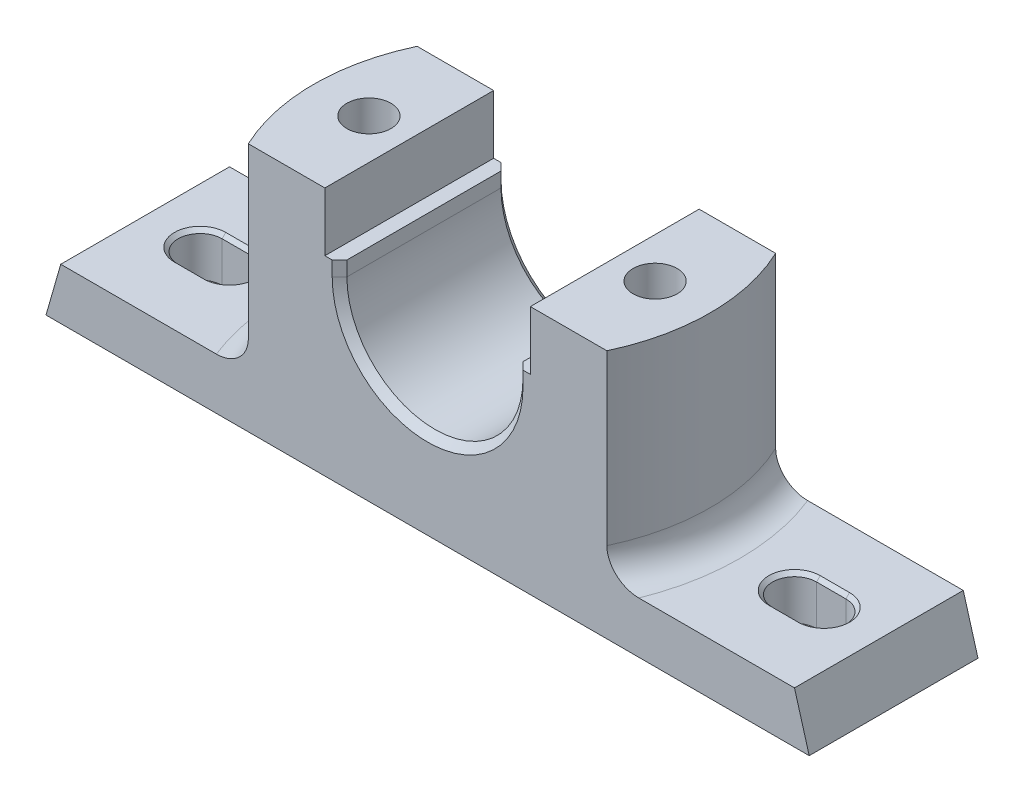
ISO-10303-21;
HEADER;
FILE_DESCRIPTION(('STEP AP214'),'2;1');
FILE_NAME('part.step','',(''),(''),'','','');
FILE_SCHEMA(('AUTOMOTIVE_DESIGN { 1 0 10303 214 1 1 1 1 }'));
ENDSEC;
DATA;
#1=APPLICATION_CONTEXT('core data for automotive mechanical design processes');
#2=APPLICATION_PROTOCOL_DEFINITION('international standard','automotive_design',2000,#1);
#3=PRODUCT_CONTEXT('',#1,'mechanical');
#4=PRODUCT('Part','Part','',(#3));
#5=PRODUCT_RELATED_PRODUCT_CATEGORY('part','',(#4));
#6=PRODUCT_DEFINITION_FORMATION('','',#4);
#7=PRODUCT_DEFINITION_CONTEXT('part definition',#1,'design');
#8=PRODUCT_DEFINITION('design','',#6,#7);
#9=PRODUCT_DEFINITION_SHAPE('','',#8);
#10=(LENGTH_UNIT() NAMED_UNIT(*) SI_UNIT(.MILLI.,.METRE.));
#11=(NAMED_UNIT(*) PLANE_ANGLE_UNIT() SI_UNIT($,.RADIAN.));
#12=(NAMED_UNIT(*) SI_UNIT($,.STERADIAN.) SOLID_ANGLE_UNIT());
#13=UNCERTAINTY_MEASURE_WITH_UNIT(LENGTH_MEASURE(1.E-05),#10,'distance_accuracy_value','');
#14=(GEOMETRIC_REPRESENTATION_CONTEXT(3) GLOBAL_UNCERTAINTY_ASSIGNED_CONTEXT((#13)) GLOBAL_UNIT_ASSIGNED_CONTEXT((#10,
#11,#12)) REPRESENTATION_CONTEXT('',''));
#15=CARTESIAN_POINT('',(0.,0.,0.));
#16=DIRECTION('',(0.,0.,1.));
#17=DIRECTION('',(1.,0.,0.));
#18=AXIS2_PLACEMENT_3D('',#15,#16,#17);
#19=CARTESIAN_POINT('',(54.,68.,23.));
#20=DIRECTION('',(0.,-1.,0.));
#21=DIRECTION('',(0.,0.,-1.));
#22=AXIS2_PLACEMENT_3D('',#19,#20,#21);
#23=PLANE('',#22);
#24=CARTESIAN_POINT('',(39.,68.,0.));
#25=DIRECTION('',(0.,1.,0.));
#26=DIRECTION('',(0.,0.,1.));
#27=AXIS2_PLACEMENT_3D('',#24,#25,#26);
#28=CIRCLE('',#27,5.99999999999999);
#29=CARTESIAN_POINT('',(39.,68.,5.99999999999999));
#30=VERTEX_POINT('',#29);
#31=EDGE_CURVE('E599',#30,#30,#28,.T.);
#32=ORIENTED_EDGE('',*,*,#31,.F.);
#33=EDGE_LOOP('',(#32));
#34=FACE_BOUND('',#33,.T.);
#35=CARTESIAN_POINT('',(0.,68.,0.));
#36=DIRECTION('',(0.,1.,0.));
#37=DIRECTION('',(0.,0.,-1.));
#38=AXIS2_PLACEMENT_3D('',#35,#36,#37);
#39=CIRCLE('',#38,54.);
#40=CARTESIAN_POINT('',(48.8569340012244,68.,23.));
#41=VERTEX_POINT('',#40);
#42=CARTESIAN_POINT('',(48.8569340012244,68.,-23.));
#43=VERTEX_POINT('',#42);
#44=EDGE_CURVE('E533',#41,#43,#39,.T.);
#45=ORIENTED_EDGE('',*,*,#44,.T.);
#46=DIRECTION('',(-1.,0.,0.));
#47=VECTOR('',#46,1.);
#48=CARTESIAN_POINT('',(54.,68.,-23.));
#49=LINE('',#48,#47);
#50=CARTESIAN_POINT('',(28.,68.,-23.));
#51=VERTEX_POINT('',#50);
#52=EDGE_CURVE('E543',#43,#51,#49,.T.);
#53=ORIENTED_EDGE('',*,*,#52,.T.);
#54=DIRECTION('',(0.,0.,-1.));
#55=VECTOR('',#54,1.);
#56=CARTESIAN_POINT('',(28.,68.,23.));
#57=LINE('',#56,#55);
#58=CARTESIAN_POINT('',(28.,68.,23.));
#59=VERTEX_POINT('',#58);
#60=EDGE_CURVE('E582',#59,#51,#57,.T.);
#61=ORIENTED_EDGE('',*,*,#60,.F.);
#62=DIRECTION('',(-1.,0.,0.));
#63=VECTOR('',#62,1.);
#64=CARTESIAN_POINT('',(54.,68.,23.));
#65=LINE('',#64,#63);
#66=EDGE_CURVE('E738',#41,#59,#65,.T.);
#67=ORIENTED_EDGE('',*,*,#66,.F.);
#68=EDGE_LOOP('',(#45,#53,#61,#67));
#69=FACE_BOUND('',#68,.T.);
#70=ADVANCED_FACE('F40',(#34,#69),#23,.F.);
#71=CARTESIAN_POINT('',(-54.,68.,23.));
#72=DIRECTION('',(0.,-1.,0.));
#73=DIRECTION('',(0.,0.,-1.));
#74=AXIS2_PLACEMENT_3D('',#71,#72,#73);
#75=PLANE('',#74);
#76=CARTESIAN_POINT('',(-39.,68.,0.));
#77=DIRECTION('',(0.,1.,0.));
#78=DIRECTION('',(0.,0.,1.));
#79=AXIS2_PLACEMENT_3D('',#76,#77,#78);
#80=CIRCLE('',#79,6.00000000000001);
#81=CARTESIAN_POINT('',(-39.,68.,6.00000000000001));
#82=VERTEX_POINT('',#81);
#83=EDGE_CURVE('E596',#82,#82,#80,.T.);
#84=ORIENTED_EDGE('',*,*,#83,.F.);
#85=EDGE_LOOP('',(#84));
#86=FACE_BOUND('',#85,.T.);
#87=CARTESIAN_POINT('',(0.,68.,0.));
#88=DIRECTION('',(0.,1.,0.));
#89=DIRECTION('',(0.,0.,1.));
#90=AXIS2_PLACEMENT_3D('',#87,#88,#89);
#91=CIRCLE('',#90,54.);
#92=CARTESIAN_POINT('',(-48.8569340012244,68.,-23.));
#93=VERTEX_POINT('',#92);
#94=CARTESIAN_POINT('',(-48.8569340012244,68.,23.));
#95=VERTEX_POINT('',#94);
#96=EDGE_CURVE('E722',#93,#95,#91,.T.);
#97=ORIENTED_EDGE('',*,*,#96,.T.);
#98=DIRECTION('',(-1.,0.,0.));
#99=VECTOR('',#98,1.);
#100=CARTESIAN_POINT('',(-54.,68.,23.));
#101=LINE('',#100,#99);
#102=CARTESIAN_POINT('',(-28.,68.,23.));
#103=VERTEX_POINT('',#102);
#104=EDGE_CURVE('E748',#103,#95,#101,.T.);
#105=ORIENTED_EDGE('',*,*,#104,.F.);
#106=DIRECTION('',(0.,0.,-1.));
#107=VECTOR('',#106,1.);
#108=CARTESIAN_POINT('',(-28.,68.,23.));
#109=LINE('',#108,#107);
#110=CARTESIAN_POINT('',(-28.,68.,-23.));
#111=VERTEX_POINT('',#110);
#112=EDGE_CURVE('E561',#103,#111,#109,.T.);
#113=ORIENTED_EDGE('',*,*,#112,.T.);
#114=DIRECTION('',(-1.,0.,0.));
#115=VECTOR('',#114,1.);
#116=CARTESIAN_POINT('',(-54.,68.,-23.));
#117=LINE('',#116,#115);
#118=EDGE_CURVE('E554',#111,#93,#117,.T.);
#119=ORIENTED_EDGE('',*,*,#118,.T.);
#120=EDGE_LOOP('',(#97,#105,#113,#119));
#121=FACE_BOUND('',#120,.T.);
#122=ADVANCED_FACE('F487',(#86,#121),#75,.F.);
#123=CARTESIAN_POINT('',(-104.,0.,23.));
#124=DIRECTION('',(0.96126169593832,-0.275637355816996,0.));
#125=DIRECTION('',(0.275637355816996,0.96126169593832,0.));
#126=AXIS2_PLACEMENT_3D('',#123,#124,#125);
#127=PLANE('',#126);
#128=DIRECTION('',(-0.275637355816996,-0.96126169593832,0.));
#129=VECTOR('',#128,1.);
#130=CARTESIAN_POINT('',(-104.,0.,-23.));
#131=LINE('',#130,#129);
#132=CARTESIAN_POINT('',(-99.9855645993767,14.,-23.));
#133=VERTEX_POINT('',#132);
#134=CARTESIAN_POINT('',(-104.,0.,-23.));
#135=VERTEX_POINT('',#134);
#136=EDGE_CURVE('E521',#133,#135,#131,.T.);
#137=ORIENTED_EDGE('',*,*,#136,.T.);
#138=DIRECTION('',(0.,0.,-1.));
#139=VECTOR('',#138,1.);
#140=CARTESIAN_POINT('',(-104.,0.,23.));
#141=LINE('',#140,#139);
#142=CARTESIAN_POINT('',(-104.,0.,23.));
#143=VERTEX_POINT('',#142);
#144=EDGE_CURVE('E348',#143,#135,#141,.T.);
#145=ORIENTED_EDGE('',*,*,#144,.F.);
#146=DIRECTION('',(-0.275637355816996,-0.96126169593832,0.));
#147=VECTOR('',#146,1.);
#148=CARTESIAN_POINT('',(-104.,0.,23.));
#149=LINE('',#148,#147);
#150=CARTESIAN_POINT('',(-99.9855645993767,14.,23.));
#151=VERTEX_POINT('',#150);
#152=EDGE_CURVE('E559',#151,#143,#149,.T.);
#153=ORIENTED_EDGE('',*,*,#152,.F.);
#154=DIRECTION('',(0.,0.,-1.));
#155=VECTOR('',#154,1.);
#156=CARTESIAN_POINT('',(-99.9855645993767,14.,23.));
#157=LINE('',#156,#155);
#158=EDGE_CURVE('E525',#151,#133,#157,.T.);
#159=ORIENTED_EDGE('',*,*,#158,.T.);
#160=EDGE_LOOP('',(#137,#145,#153,#159));
#161=FACE_BOUND('',#160,.T.);
#162=ADVANCED_FACE('F493',(#161),#127,.F.);
#163=CARTESIAN_POINT('',(-104.,0.,23.));
#164=DIRECTION('',(0.,1.,0.));
#165=DIRECTION('',(0.,0.,1.));
#166=AXIS2_PLACEMENT_3D('',#163,#164,#165);
#167=PLANE('',#166);
#168=DIRECTION('',(1.,0.,0.));
#169=VECTOR('',#168,1.);
#170=CARTESIAN_POINT('',(-97.5,0.,-17.5));
#171=LINE('',#170,#169);
#172=CARTESIAN_POINT('',(-97.5,0.,-17.5));
#173=VERTEX_POINT('',#172);
#174=CARTESIAN_POINT('',(97.5,0.,-17.5));
#175=VERTEX_POINT('',#174);
#176=EDGE_CURVE('E702',#173,#175,#171,.T.);
#177=ORIENTED_EDGE('',*,*,#176,.F.);
#178=DIRECTION('',(0.,0.,-1.));
#179=VECTOR('',#178,1.);
#180=CARTESIAN_POINT('',(-97.5,0.,17.5));
#181=LINE('',#180,#179);
#182=CARTESIAN_POINT('',(-97.5,0.,17.5));
#183=VERTEX_POINT('',#182);
#184=EDGE_CURVE('E650',#183,#173,#181,.T.);
#185=ORIENTED_EDGE('',*,*,#184,.F.);
#186=DIRECTION('',(-1.,0.,0.));
#187=VECTOR('',#186,1.);
#188=CARTESIAN_POINT('',(-97.5,0.,17.5));
#189=LINE('',#188,#187);
#190=CARTESIAN_POINT('',(97.5,0.,17.5));
#191=VERTEX_POINT('',#190);
#192=EDGE_CURVE('E691',#191,#183,#189,.T.);
#193=ORIENTED_EDGE('',*,*,#192,.F.);
#194=DIRECTION('',(0.,0.,1.));
#195=VECTOR('',#194,1.);
#196=CARTESIAN_POINT('',(97.5,0.,17.5));
#197=LINE('',#196,#195);
#198=EDGE_CURVE('E705',#175,#191,#197,.T.);
#199=ORIENTED_EDGE('',*,*,#198,.F.);
#200=EDGE_LOOP('',(#177,#185,#193,#199));
#201=FACE_BOUND('',#200,.T.);
#202=DIRECTION('',(1.,0.,0.));
#203=VECTOR('',#202,1.);
#204=CARTESIAN_POINT('',(-104.,0.,-23.));
#205=LINE('',#204,#203);
#206=CARTESIAN_POINT('',(104.,0.,-23.));
#207=VERTEX_POINT('',#206);
#208=EDGE_CURVE('E528',#135,#207,#205,.T.);
#209=ORIENTED_EDGE('',*,*,#208,.T.);
#210=DIRECTION('',(0.,0.,-1.));
#211=VECTOR('',#210,1.);
#212=CARTESIAN_POINT('',(104.,0.,23.));
#213=LINE('',#212,#211);
#214=CARTESIAN_POINT('',(104.,0.,23.));
#215=VERTEX_POINT('',#214);
#216=EDGE_CURVE('E588',#215,#207,#213,.T.);
#217=ORIENTED_EDGE('',*,*,#216,.F.);
#218=DIRECTION('',(1.,0.,0.));
#219=VECTOR('',#218,1.);
#220=CARTESIAN_POINT('',(-104.,0.,23.));
#221=LINE('',#220,#219);
#222=EDGE_CURVE('E731',#143,#215,#221,.T.);
#223=ORIENTED_EDGE('',*,*,#222,.F.);
#224=ORIENTED_EDGE('',*,*,#144,.T.);
#225=EDGE_LOOP('',(#209,#217,#223,#224));
#226=FACE_BOUND('',#225,.T.);
#227=ADVANCED_FACE('F509',(#201,#226),#167,.F.);
#228=CARTESIAN_POINT('',(104.,0.,23.));
#229=DIRECTION('',(-0.96126169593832,-0.275637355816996,0.));
#230=DIRECTION('',(0.275637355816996,-0.96126169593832,0.));
#231=AXIS2_PLACEMENT_3D('',#228,#229,#230);
#232=PLANE('',#231);
#233=DIRECTION('',(-0.275637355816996,0.96126169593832,0.));
#234=VECTOR('',#233,1.);
#235=CARTESIAN_POINT('',(104.,0.,-23.));
#236=LINE('',#235,#234);
#237=CARTESIAN_POINT('',(99.9855645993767,14.,-23.));
#238=VERTEX_POINT('',#237);
#239=EDGE_CURVE('E531',#207,#238,#236,.T.);
#240=ORIENTED_EDGE('',*,*,#239,.T.);
#241=DIRECTION('',(0.,0.,-1.));
#242=VECTOR('',#241,1.);
#243=CARTESIAN_POINT('',(99.9855645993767,14.,23.));
#244=LINE('',#243,#242);
#245=CARTESIAN_POINT('',(99.9855645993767,14.,23.));
#246=VERTEX_POINT('',#245);
#247=EDGE_CURVE('E585',#246,#238,#244,.T.);
#248=ORIENTED_EDGE('',*,*,#247,.F.);
#249=DIRECTION('',(-0.275637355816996,0.96126169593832,0.));
#250=VECTOR('',#249,1.);
#251=CARTESIAN_POINT('',(104.,0.,23.));
#252=LINE('',#251,#250);
#253=EDGE_CURVE('E733',#215,#246,#252,.T.);
#254=ORIENTED_EDGE('',*,*,#253,.F.);
#255=ORIENTED_EDGE('',*,*,#216,.T.);
#256=EDGE_LOOP('',(#240,#248,#254,#255));
#257=FACE_BOUND('',#256,.T.);
#258=ADVANCED_FACE('F505',(#257),#232,.F.);
#259=CARTESIAN_POINT('',(99.9855645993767,14.,23.));
#260=DIRECTION('',(0.,-1.,0.));
#261=DIRECTION('',(1.,0.,0.));
#262=AXIS2_PLACEMENT_3D('',#259,#260,#261);
#263=PLANE('',#262);
#264=DIRECTION('',(1.,0.,0.));
#265=VECTOR('',#264,1.);
#266=CARTESIAN_POINT('',(99.9855645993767,14.,-7.00000000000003));
#267=LINE('',#266,#265);
#268=CARTESIAN_POINT('',(77.,14.,-7.00000000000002));
#269=VERTEX_POINT('',#268);
#270=CARTESIAN_POINT('',(85.,14.,-7.00000000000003));
#271=VERTEX_POINT('',#270);
#272=EDGE_CURVE('E887',#269,#271,#267,.T.);
#273=ORIENTED_EDGE('',*,*,#272,.T.);
#274=CARTESIAN_POINT('',(85.,14.,0.));
#275=DIRECTION('',(0.,-1.,0.));
#276=DIRECTION('',(1.,0.,0.));
#277=AXIS2_PLACEMENT_3D('',#274,#275,#276);
#278=CIRCLE('',#277,7.00000000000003);
#279=CARTESIAN_POINT('',(85.,14.,7.00000000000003));
#280=VERTEX_POINT('',#279);
#281=EDGE_CURVE('E884',#271,#280,#278,.T.);
#282=ORIENTED_EDGE('',*,*,#281,.T.);
#283=DIRECTION('',(-1.,0.,0.));
#284=VECTOR('',#283,1.);
#285=CARTESIAN_POINT('',(99.9855645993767,14.,7.00000000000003));
#286=LINE('',#285,#284);
#287=CARTESIAN_POINT('',(77.,14.,7.00000000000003));
#288=VERTEX_POINT('',#287);
#289=EDGE_CURVE('E890',#280,#288,#286,.T.);
#290=ORIENTED_EDGE('',*,*,#289,.T.);
#291=CARTESIAN_POINT('',(77.,14.,0.));
#292=DIRECTION('',(0.,-1.,0.));
#293=DIRECTION('',(1.,0.,0.));
#294=AXIS2_PLACEMENT_3D('',#291,#292,#293);
#295=CIRCLE('',#294,7.00000000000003);
#296=EDGE_CURVE('E889',#288,#269,#295,.T.);
#297=ORIENTED_EDGE('',*,*,#296,.T.);
#298=EDGE_LOOP('',(#273,#282,#290,#297));
#299=FACE_BOUND('',#298,.T.);
#300=DIRECTION('',(-1.,0.,0.));
#301=VECTOR('',#300,1.);
#302=CARTESIAN_POINT('',(99.9855645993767,14.,-23.));
#303=LINE('',#302,#301);
#304=CARTESIAN_POINT('',(57.5760366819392,14.,-23.));
#305=VERTEX_POINT('',#304);
#306=EDGE_CURVE('E540',#238,#305,#303,.T.);
#307=ORIENTED_EDGE('',*,*,#306,.T.);
#308=CARTESIAN_POINT('',(0.,14.,0.));
#309=DIRECTION('',(0.,-1.,0.));
#310=DIRECTION('',(1.,0.,0.));
#311=AXIS2_PLACEMENT_3D('',#308,#309,#310);
#312=CIRCLE('',#311,62.);
#313=CARTESIAN_POINT('',(57.5760366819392,14.,23.));
#314=VERTEX_POINT('',#313);
#315=EDGE_CURVE('E384',#305,#314,#312,.T.);
#316=ORIENTED_EDGE('',*,*,#315,.T.);
#317=DIRECTION('',(-1.,0.,0.));
#318=VECTOR('',#317,1.);
#319=CARTESIAN_POINT('',(99.9855645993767,14.,23.));
#320=LINE('',#319,#318);
#321=EDGE_CURVE('E735',#246,#314,#320,.T.);
#322=ORIENTED_EDGE('',*,*,#321,.F.);
#323=ORIENTED_EDGE('',*,*,#247,.T.);
#324=EDGE_LOOP('',(#307,#316,#322,#323));
#325=FACE_BOUND('',#324,.T.);
#326=ADVANCED_FACE('F502',(#299,#325),#263,.F.);
#327=CARTESIAN_POINT('',(28.,68.,23.));
#328=DIRECTION('',(1.,0.,0.));
#329=DIRECTION('',(0.,1.,0.));
#330=AXIS2_PLACEMENT_3D('',#327,#328,#329);
#331=PLANE('',#330);
#332=DIRECTION('',(0.,-1.,0.));
#333=VECTOR('',#332,1.);
#334=CARTESIAN_POINT('',(28.,68.,-23.));
#335=LINE('',#334,#333);
#336=CARTESIAN_POINT('',(28.,52.,-23.));
#337=VERTEX_POINT('',#336);
#338=EDGE_CURVE('E545',#51,#337,#335,.T.);
#339=ORIENTED_EDGE('',*,*,#338,.T.);
#340=DIRECTION('',(0.,0.,-1.));
#341=VECTOR('',#340,1.);
#342=CARTESIAN_POINT('',(28.,52.,23.));
#343=LINE('',#342,#341);
#344=CARTESIAN_POINT('',(28.,52.,23.));
#345=VERTEX_POINT('',#344);
#346=EDGE_CURVE('E579',#345,#337,#343,.T.);
#347=ORIENTED_EDGE('',*,*,#346,.F.);
#348=DIRECTION('',(0.,-1.,0.));
#349=VECTOR('',#348,1.);
#350=CARTESIAN_POINT('',(28.,68.,23.));
#351=LINE('',#350,#349);
#352=EDGE_CURVE('E740',#59,#345,#351,.T.);
#353=ORIENTED_EDGE('',*,*,#352,.F.);
#354=ORIENTED_EDGE('',*,*,#60,.T.);
#355=EDGE_LOOP('',(#339,#347,#353,#354));
#356=FACE_BOUND('',#355,.T.);
#357=ADVANCED_FACE('F500',(#356),#331,.F.);
#358=CARTESIAN_POINT('',(28.,52.,23.));
#359=DIRECTION('',(0.,-1.,0.));
#360=DIRECTION('',(0.,0.,-1.));
#361=AXIS2_PLACEMENT_3D('',#358,#359,#360);
#362=PLANE('',#361);
#363=DIRECTION('',(-1.,0.,0.));
#364=VECTOR('',#363,1.);
#365=CARTESIAN_POINT('',(28.,52.,-23.));
#366=LINE('',#365,#364);
#367=CARTESIAN_POINT('',(26.,52.,-23.));
#368=VERTEX_POINT('',#367);
#369=EDGE_CURVE('E547',#337,#368,#366,.T.);
#370=ORIENTED_EDGE('',*,*,#369,.T.);
#371=DIRECTION('',(0.707106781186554,0.,-0.707106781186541));
#372=VECTOR('',#371,1.);
#373=CARTESIAN_POINT('',(24.,52.,-21.0000000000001));
#374=LINE('',#373,#372);
#375=CARTESIAN_POINT('',(24.,52.,-21.0000000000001));
#376=VERTEX_POINT('',#375);
#377=EDGE_CURVE('E786',#368,#376,#374,.F.);
#378=ORIENTED_EDGE('',*,*,#377,.T.);
#379=DIRECTION('',(0.,0.,-1.));
#380=VECTOR('',#379,1.);
#381=CARTESIAN_POINT('',(24.,52.,23.));
#382=LINE('',#381,#380);
#383=CARTESIAN_POINT('',(24.,52.,21.));
#384=VERTEX_POINT('',#383);
#385=EDGE_CURVE('E576',#384,#376,#382,.T.);
#386=ORIENTED_EDGE('',*,*,#385,.F.);
#387=DIRECTION('',(0.707106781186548,0.,0.707106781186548));
#388=VECTOR('',#387,1.);
#389=CARTESIAN_POINT('',(26.,52.,23.));
#390=LINE('',#389,#388);
#391=CARTESIAN_POINT('',(26.,52.,23.));
#392=VERTEX_POINT('',#391);
#393=EDGE_CURVE('E785',#384,#392,#390,.T.);
#394=ORIENTED_EDGE('',*,*,#393,.T.);
#395=DIRECTION('',(-1.,0.,0.));
#396=VECTOR('',#395,1.);
#397=CARTESIAN_POINT('',(28.,52.,23.));
#398=LINE('',#397,#396);
#399=EDGE_CURVE('E742',#345,#392,#398,.T.);
#400=ORIENTED_EDGE('',*,*,#399,.F.);
#401=ORIENTED_EDGE('',*,*,#346,.T.);
#402=EDGE_LOOP('',(#370,#378,#386,#394,#400,#401));
#403=FACE_BOUND('',#402,.T.);
#404=ADVANCED_FACE('F782',(#403),#362,.F.);
#405=CARTESIAN_POINT('',(24.,52.,23.));
#406=DIRECTION('',(1.,0.,0.));
#407=DIRECTION('',(0.,0.,-1.));
#408=AXIS2_PLACEMENT_3D('',#405,#406,#407);
#409=PLANE('',#408);
#410=ORIENTED_EDGE('',*,*,#385,.T.);
#411=DIRECTION('',(0.,-1.,0.));
#412=VECTOR('',#411,1.);
#413=CARTESIAN_POINT('',(24.,52.,-21.0000000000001));
#414=LINE('',#413,#412);
#415=CARTESIAN_POINT('',(24.,48.,-21.0000000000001));
#416=VERTEX_POINT('',#415);
#417=EDGE_CURVE('E838',#376,#416,#414,.T.);
#418=ORIENTED_EDGE('',*,*,#417,.T.);
#419=DIRECTION('',(0.,0.,-1.));
#420=VECTOR('',#419,1.);
#421=CARTESIAN_POINT('',(24.,48.,23.));
#422=LINE('',#421,#420);
#423=CARTESIAN_POINT('',(24.,48.,21.));
#424=VERTEX_POINT('',#423);
#425=EDGE_CURVE('E573',#424,#416,#422,.T.);
#426=ORIENTED_EDGE('',*,*,#425,.F.);
#427=DIRECTION('',(0.,1.,0.));
#428=VECTOR('',#427,1.);
#429=CARTESIAN_POINT('',(24.,52.,21.));
#430=LINE('',#429,#428);
#431=EDGE_CURVE('E843',#424,#384,#430,.T.);
#432=ORIENTED_EDGE('',*,*,#431,.T.);
#433=EDGE_LOOP('',(#410,#418,#426,#432));
#434=FACE_BOUND('',#433,.T.);
#435=ADVANCED_FACE('F1004',(#434),#409,.F.);
#436=CARTESIAN_POINT('',(0.,48.,23.));
#437=DIRECTION('',(0.,0.,-1.));
#438=DIRECTION('',(-1.,0.,0.));
#439=AXIS2_PLACEMENT_3D('',#436,#437,#438);
#440=CYLINDRICAL_SURFACE('',#439,24.);
#441=ORIENTED_EDGE('',*,*,#425,.T.);
#442=CARTESIAN_POINT('',(0.,48.,-21.0000000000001));
#443=DIRECTION('',(0.,0.,1.));
#444=DIRECTION('',(1.,0.,0.));
#445=AXIS2_PLACEMENT_3D('',#442,#443,#444);
#446=CIRCLE('',#445,24.);
#447=CARTESIAN_POINT('',(-24.,48.,-21.0000000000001));
#448=VERTEX_POINT('',#447);
#449=EDGE_CURVE('E804',#416,#448,#446,.F.);
#450=ORIENTED_EDGE('',*,*,#449,.T.);
#451=DIRECTION('',(0.,0.,-1.));
#452=VECTOR('',#451,1.);
#453=CARTESIAN_POINT('',(-24.,48.,23.));
#454=LINE('',#453,#452);
#455=CARTESIAN_POINT('',(-24.,48.,21.));
#456=VERTEX_POINT('',#455);
#457=EDGE_CURVE('E570',#456,#448,#454,.T.);
#458=ORIENTED_EDGE('',*,*,#457,.F.);
#459=CARTESIAN_POINT('',(0.,48.,21.));
#460=DIRECTION('',(0.,0.,1.));
#461=DIRECTION('',(1.,0.,0.));
#462=AXIS2_PLACEMENT_3D('',#459,#460,#461);
#463=CIRCLE('',#462,24.);
#464=EDGE_CURVE('E802',#456,#424,#463,.T.);
#465=ORIENTED_EDGE('',*,*,#464,.T.);
#466=EDGE_LOOP('',(#441,#450,#458,#465));
#467=FACE_BOUND('',#466,.T.);
#468=ADVANCED_FACE('F996',(#467),#440,.F.);
#469=CARTESIAN_POINT('',(-24.,52.,23.));
#470=DIRECTION('',(-1.,0.,0.));
#471=DIRECTION('',(0.,0.,1.));
#472=AXIS2_PLACEMENT_3D('',#469,#470,#471);
#473=PLANE('',#472);
#474=ORIENTED_EDGE('',*,*,#457,.T.);
#475=DIRECTION('',(0.,1.,0.));
#476=VECTOR('',#475,1.);
#477=CARTESIAN_POINT('',(-24.,52.,-21.0000000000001));
#478=LINE('',#477,#476);
#479=CARTESIAN_POINT('',(-24.,52.,-21.0000000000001));
#480=VERTEX_POINT('',#479);
#481=EDGE_CURVE('E796',#448,#480,#478,.T.);
#482=ORIENTED_EDGE('',*,*,#481,.T.);
#483=DIRECTION('',(0.,0.,-1.));
#484=VECTOR('',#483,1.);
#485=CARTESIAN_POINT('',(-24.,52.,23.));
#486=LINE('',#485,#484);
#487=CARTESIAN_POINT('',(-24.,52.,21.));
#488=VERTEX_POINT('',#487);
#489=EDGE_CURVE('E567',#488,#480,#486,.T.);
#490=ORIENTED_EDGE('',*,*,#489,.F.);
#491=DIRECTION('',(0.,-1.,0.));
#492=VECTOR('',#491,1.);
#493=CARTESIAN_POINT('',(-24.,48.,21.));
#494=LINE('',#493,#492);
#495=EDGE_CURVE('E789',#488,#456,#494,.T.);
#496=ORIENTED_EDGE('',*,*,#495,.T.);
#497=EDGE_LOOP('',(#474,#482,#490,#496));
#498=FACE_BOUND('',#497,.T.);
#499=ADVANCED_FACE('F989',(#498),#473,.F.);
#500=CARTESIAN_POINT('',(-28.,52.,23.));
#501=DIRECTION('',(0.,-1.,0.));
#502=DIRECTION('',(0.,0.,-1.));
#503=AXIS2_PLACEMENT_3D('',#500,#501,#502);
#504=PLANE('',#503);
#505=ORIENTED_EDGE('',*,*,#489,.T.);
#506=DIRECTION('',(0.707106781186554,0.,0.707106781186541));
#507=VECTOR('',#506,1.);
#508=CARTESIAN_POINT('',(-24.,52.,-21.0000000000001));
#509=LINE('',#508,#507);
#510=CARTESIAN_POINT('',(-26.,52.,-23.));
#511=VERTEX_POINT('',#510);
#512=EDGE_CURVE('E800',#480,#511,#509,.F.);
#513=ORIENTED_EDGE('',*,*,#512,.T.);
#514=DIRECTION('',(-1.,0.,0.));
#515=VECTOR('',#514,1.);
#516=CARTESIAN_POINT('',(-28.,52.,-23.));
#517=LINE('',#516,#515);
#518=CARTESIAN_POINT('',(-28.,52.,-23.));
#519=VERTEX_POINT('',#518);
#520=EDGE_CURVE('E550',#511,#519,#517,.T.);
#521=ORIENTED_EDGE('',*,*,#520,.T.);
#522=DIRECTION('',(0.,0.,-1.));
#523=VECTOR('',#522,1.);
#524=CARTESIAN_POINT('',(-28.,52.,23.));
#525=LINE('',#524,#523);
#526=CARTESIAN_POINT('',(-28.,52.,23.));
#527=VERTEX_POINT('',#526);
#528=EDGE_CURVE('E564',#527,#519,#525,.T.);
#529=ORIENTED_EDGE('',*,*,#528,.F.);
#530=DIRECTION('',(-1.,0.,0.));
#531=VECTOR('',#530,1.);
#532=CARTESIAN_POINT('',(-28.,52.,23.));
#533=LINE('',#532,#531);
#534=CARTESIAN_POINT('',(-26.,52.,23.));
#535=VERTEX_POINT('',#534);
#536=EDGE_CURVE('E745',#535,#527,#533,.T.);
#537=ORIENTED_EDGE('',*,*,#536,.F.);
#538=DIRECTION('',(0.707106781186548,0.,-0.707106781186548));
#539=VECTOR('',#538,1.);
#540=CARTESIAN_POINT('',(-26.,52.,23.));
#541=LINE('',#540,#539);
#542=EDGE_CURVE('E798',#535,#488,#541,.T.);
#543=ORIENTED_EDGE('',*,*,#542,.T.);
#544=EDGE_LOOP('',(#505,#513,#521,#529,#537,#543));
#545=FACE_BOUND('',#544,.T.);
#546=ADVANCED_FACE('F820',(#545),#504,.F.);
#547=CARTESIAN_POINT('',(-28.,68.,23.));
#548=DIRECTION('',(-1.,0.,0.));
#549=DIRECTION('',(0.,-1.,0.));
#550=AXIS2_PLACEMENT_3D('',#547,#548,#549);
#551=PLANE('',#550);
#552=DIRECTION('',(0.,1.,0.));
#553=VECTOR('',#552,1.);
#554=CARTESIAN_POINT('',(-28.,68.,-23.));
#555=LINE('',#554,#553);
#556=EDGE_CURVE('E552',#519,#111,#555,.T.);
#557=ORIENTED_EDGE('',*,*,#556,.T.);
#558=ORIENTED_EDGE('',*,*,#112,.F.);
#559=DIRECTION('',(0.,1.,0.));
#560=VECTOR('',#559,1.);
#561=CARTESIAN_POINT('',(-28.,68.,23.));
#562=LINE('',#561,#560);
#563=EDGE_CURVE('E747',#527,#103,#562,.T.);
#564=ORIENTED_EDGE('',*,*,#563,.F.);
#565=ORIENTED_EDGE('',*,*,#528,.T.);
#566=EDGE_LOOP('',(#557,#558,#564,#565));
#567=FACE_BOUND('',#566,.T.);
#568=ADVANCED_FACE('F827',(#567),#551,.F.);
#569=CARTESIAN_POINT('',(-99.9855645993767,14.,23.));
#570=DIRECTION('',(0.,-1.,0.));
#571=DIRECTION('',(1.,0.,0.));
#572=AXIS2_PLACEMENT_3D('',#569,#570,#571);
#573=PLANE('',#572);
#574=CARTESIAN_POINT('',(-85.,14.,0.));
#575=DIRECTION('',(0.,-1.,0.));
#576=DIRECTION('',(1.,0.,0.));
#577=AXIS2_PLACEMENT_3D('',#574,#575,#576);
#578=CIRCLE('',#577,7.00000000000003);
#579=CARTESIAN_POINT('',(-85.,14.,7.00000000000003));
#580=VERTEX_POINT('',#579);
#581=CARTESIAN_POINT('',(-85.,14.,-7.00000000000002));
#582=VERTEX_POINT('',#581);
#583=EDGE_CURVE('E870',#580,#582,#578,.T.);
#584=ORIENTED_EDGE('',*,*,#583,.T.);
#585=DIRECTION('',(1.,0.,0.));
#586=VECTOR('',#585,1.);
#587=CARTESIAN_POINT('',(-99.9855645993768,14.,-7.00000000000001));
#588=LINE('',#587,#586);
#589=CARTESIAN_POINT('',(-77.,14.,-7.00000000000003));
#590=VERTEX_POINT('',#589);
#591=EDGE_CURVE('E867',#582,#590,#588,.T.);
#592=ORIENTED_EDGE('',*,*,#591,.T.);
#593=CARTESIAN_POINT('',(-77.,14.,0.));
#594=DIRECTION('',(0.,-1.,0.));
#595=DIRECTION('',(1.,0.,0.));
#596=AXIS2_PLACEMENT_3D('',#593,#594,#595);
#597=CIRCLE('',#596,7.00000000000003);
#598=CARTESIAN_POINT('',(-77.,14.,7.00000000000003));
#599=VERTEX_POINT('',#598);
#600=EDGE_CURVE('E872',#590,#599,#597,.T.);
#601=ORIENTED_EDGE('',*,*,#600,.T.);
#602=DIRECTION('',(-1.,0.,0.));
#603=VECTOR('',#602,1.);
#604=CARTESIAN_POINT('',(-99.9855645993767,14.,7.00000000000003));
#605=LINE('',#604,#603);
#606=EDGE_CURVE('E874',#599,#580,#605,.T.);
#607=ORIENTED_EDGE('',*,*,#606,.T.);
#608=EDGE_LOOP('',(#584,#592,#601,#607));
#609=FACE_BOUND('',#608,.T.);
#610=DIRECTION('',(-1.,0.,0.));
#611=VECTOR('',#610,1.);
#612=CARTESIAN_POINT('',(-99.9855645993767,14.,23.));
#613=LINE('',#612,#611);
#614=CARTESIAN_POINT('',(-57.5760366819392,14.,23.));
#615=VERTEX_POINT('',#614);
#616=EDGE_CURVE('E536',#615,#151,#613,.T.);
#617=ORIENTED_EDGE('',*,*,#616,.F.);
#618=CARTESIAN_POINT('',(0.,14.,0.));
#619=DIRECTION('',(0.,-1.,0.));
#620=DIRECTION('',(1.,0.,0.));
#621=AXIS2_PLACEMENT_3D('',#618,#619,#620);
#622=CIRCLE('',#621,62.);
#623=CARTESIAN_POINT('',(-57.5760366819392,14.,-23.));
#624=VERTEX_POINT('',#623);
#625=EDGE_CURVE('E379',#615,#624,#622,.T.);
#626=ORIENTED_EDGE('',*,*,#625,.T.);
#627=DIRECTION('',(-1.,0.,0.));
#628=VECTOR('',#627,1.);
#629=CARTESIAN_POINT('',(-99.9855645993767,14.,-23.));
#630=LINE('',#629,#628);
#631=EDGE_CURVE('E557',#624,#133,#630,.T.);
#632=ORIENTED_EDGE('',*,*,#631,.T.);
#633=ORIENTED_EDGE('',*,*,#158,.F.);
#634=EDGE_LOOP('',(#617,#626,#632,#633));
#635=FACE_BOUND('',#634,.T.);
#636=ADVANCED_FACE('F408',(#609,#635),#573,.F.);
#637=CARTESIAN_POINT('',(0.,48.,23.));
#638=DIRECTION('',(0.,0.,1.));
#639=DIRECTION('',(1.,0.,0.));
#640=AXIS2_PLACEMENT_3D('',#637,#638,#639);
#641=PLANE('',#640);
#642=ORIENTED_EDGE('',*,*,#399,.T.);
#643=DIRECTION('',(0.,-1.,0.));
#644=VECTOR('',#643,1.);
#645=CARTESIAN_POINT('',(26.,48.,23.));
#646=LINE('',#645,#644);
#647=CARTESIAN_POINT('',(26.,48.,23.));
#648=VERTEX_POINT('',#647);
#649=EDGE_CURVE('E12',#392,#648,#646,.T.);
#650=ORIENTED_EDGE('',*,*,#649,.T.);
#651=CARTESIAN_POINT('',(0.,48.,23.));
#652=DIRECTION('',(0.,0.,1.));
#653=DIRECTION('',(1.,0.,0.));
#654=AXIS2_PLACEMENT_3D('',#651,#652,#653);
#655=CIRCLE('',#654,26.);
#656=CARTESIAN_POINT('',(-26.,48.,23.));
#657=VERTEX_POINT('',#656);
#658=EDGE_CURVE('E56',#648,#657,#655,.F.);
#659=ORIENTED_EDGE('',*,*,#658,.T.);
#660=DIRECTION('',(0.,1.,0.));
#661=VECTOR('',#660,1.);
#662=CARTESIAN_POINT('',(-26.,52.,23.));
#663=LINE('',#662,#661);
#664=EDGE_CURVE('E49',#657,#535,#663,.T.);
#665=ORIENTED_EDGE('',*,*,#664,.T.);
#666=ORIENTED_EDGE('',*,*,#536,.T.);
#667=ORIENTED_EDGE('',*,*,#563,.T.);
#668=ORIENTED_EDGE('',*,*,#104,.T.);
#669=DIRECTION('',(0.,1.,0.));
#670=VECTOR('',#669,1.);
#671=CARTESIAN_POINT('',(-48.8569340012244,-204.022498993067,23.));
#672=LINE('',#671,#670);
#673=CARTESIAN_POINT('',(-48.8569340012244,22.,23.));
#674=VERTEX_POINT('',#673);
#675=EDGE_CURVE('E529',#674,#95,#672,.T.);
#676=ORIENTED_EDGE('',*,*,#675,.F.);
#677=CARTESIAN_POINT('',(-48.8569340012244,22.,23.));
#678=CARTESIAN_POINT('',(-48.8568944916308,21.7897037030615,23.));
#679=CARTESIAN_POINT('',(-48.8660972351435,21.5794200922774,23.));
#680=CARTESIAN_POINT('',(-48.9026955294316,21.1604976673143,23.));
#681=CARTESIAN_POINT('',(-48.9300861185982,20.9518584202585,23.));
#682=CARTESIAN_POINT('',(-49.0026422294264,20.5384483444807,23.));
#683=CARTESIAN_POINT('',(-49.0477455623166,20.333666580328,23.));
#684=CARTESIAN_POINT('',(-49.1551914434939,19.928676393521,23.));
#685=CARTESIAN_POINT('',(-49.2175345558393,19.7284681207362,23.));
#686=CARTESIAN_POINT('',(-49.3587056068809,19.3341515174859,23.));
#687=CARTESIAN_POINT('',(-49.4375194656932,19.1400381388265,23.));
#688=CARTESIAN_POINT('',(-49.6108643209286,18.7588835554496,23.));
#689=CARTESIAN_POINT('',(-49.7054011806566,18.5718450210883,23.));
#690=CARTESIAN_POINT('',(-49.9092601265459,18.2059678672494,23.));
#691=CARTESIAN_POINT('',(-50.0185851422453,18.0271308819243,23.));
#692=CARTESIAN_POINT('',(-50.251044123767,17.6785870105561,23.));
#693=CARTESIAN_POINT('',(-50.3741833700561,17.5088836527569,23.));
#694=CARTESIAN_POINT('',(-50.6386238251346,17.1726098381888,23.));
#695=CARTESIAN_POINT('',(-50.7804689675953,17.0064666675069,23.));
#696=CARTESIAN_POINT('',(-51.0768009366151,16.6858302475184,23.));
#697=CARTESIAN_POINT('',(-51.2312923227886,16.5313412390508,23.));
#698=CARTESIAN_POINT('',(-51.7119073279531,16.0864805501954,23.));
#699=CARTESIAN_POINT('',(-52.0553511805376,15.8144890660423,23.));
#700=CARTESIAN_POINT('',(-52.8107494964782,15.3025371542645,23.));
#701=CARTESIAN_POINT('',(-53.2260819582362,15.0675926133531,23.));
#702=CARTESIAN_POINT('',(-54.0883596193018,14.665281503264,23.));
#703=CARTESIAN_POINT('',(-54.5353157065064,14.497938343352,23.));
#704=CARTESIAN_POINT('',(-55.4119481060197,14.2445948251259,23.));
#705=CARTESIAN_POINT('',(-55.8400171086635,14.1530314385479,23.));
#706=CARTESIAN_POINT('',(-56.488037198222,14.0613163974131,23.));
#707=CARTESIAN_POINT('',(-56.7049685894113,14.0383497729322,23.));
#708=CARTESIAN_POINT('',(-57.1399216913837,14.0076931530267,23.));
#709=CARTESIAN_POINT('',(-57.3579434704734,14.0000041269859,23.));
#710=CARTESIAN_POINT('',(-57.5760366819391,14.,23.));
#711=B_SPLINE_CURVE_WITH_KNOTS('',3,(#677,#678,#679,#680,#681,#682,#683,#684,#685,#686,#687,
#688,#689,#690,#691,#692,#693,#694,#695,#696,#697,#698,#699,#700,#701,#702,#703,#704,#705,#706,
#707,#708,#709,#710),.UNSPECIFIED.,.F.,.F.,(4,2,2,2,2,2,2,2,2,2,2,2,2,2,2,2,4),(0.,
0.630667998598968,1.26116402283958,1.8894659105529,2.51778835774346,3.1455758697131,
3.77359801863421,4.40174476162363,5.03013243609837,5.6847801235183,6.33966489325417,
7.64857785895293,9.07415774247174,10.5002308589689,11.8088856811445,12.462847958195,
13.1168517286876),.UNSPECIFIED.);
#712=EDGE_CURVE('E386',#674,#615,#711,.T.);
#713=ORIENTED_EDGE('',*,*,#712,.T.);
#714=ORIENTED_EDGE('',*,*,#616,.T.);
#715=ORIENTED_EDGE('',*,*,#152,.T.);
#716=ORIENTED_EDGE('',*,*,#222,.T.);
#717=ORIENTED_EDGE('',*,*,#253,.T.);
#718=ORIENTED_EDGE('',*,*,#321,.T.);
#719=CARTESIAN_POINT('',(57.5760366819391,14.,23.));
#720=CARTESIAN_POINT('',(57.3157465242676,13.9999861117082,23.));
#721=CARTESIAN_POINT('',(57.0554642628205,14.0109545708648,23.));
#722=CARTESIAN_POINT('',(56.5367274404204,14.0546304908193,23.));
#723=CARTESIAN_POINT('',(56.2782728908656,14.0873380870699,23.));
#724=CARTESIAN_POINT('',(55.7647130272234,14.17431631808,23.));
#725=CARTESIAN_POINT('',(55.5096118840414,14.228611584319,23.));
#726=CARTESIAN_POINT('',(55.0048736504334,14.3584433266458,23.));
#727=CARTESIAN_POINT('',(54.7552364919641,14.4339795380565,23.));
#728=CARTESIAN_POINT('',(54.2630898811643,14.605957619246,23.));
#729=CARTESIAN_POINT('',(54.0205849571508,14.7024124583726,23.));
#730=CARTESIAN_POINT('',(53.5446290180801,14.9157643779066,23.));
#731=CARTESIAN_POINT('',(53.3111812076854,15.0326686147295,23.));
#732=CARTESIAN_POINT('',(52.8554559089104,15.2862486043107,23.));
#733=CARTESIAN_POINT('',(52.6331717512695,15.4229123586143,23.));
#734=CARTESIAN_POINT('',(52.2015693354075,15.7153670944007,23.));
#735=CARTESIAN_POINT('',(51.9922500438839,15.8711565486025,23.));
#736=CARTESIAN_POINT('',(51.5944194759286,16.1962302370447,23.));
#737=CARTESIAN_POINT('',(51.4054800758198,16.3649902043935,23.));
#738=CARTESIAN_POINT('',(51.0436072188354,16.7187493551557,23.));
#739=CARTESIAN_POINT('',(50.8706666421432,16.9037412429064,23.));
#740=CARTESIAN_POINT('',(50.5425384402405,17.2889300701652,23.));
#741=CARTESIAN_POINT('',(50.3873540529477,17.4891297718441,23.));
#742=CARTESIAN_POINT('',(50.0966425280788,17.903321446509,23.));
#743=CARTESIAN_POINT('',(49.9611128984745,18.1173116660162,23.));
#744=CARTESIAN_POINT('',(49.7218092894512,18.5392382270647,23.));
#745=CARTESIAN_POINT('',(49.6163360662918,18.7462117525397,23.));
#746=CARTESIAN_POINT('',(49.4246955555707,19.1689008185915,23.));
#747=CARTESIAN_POINT('',(49.3385256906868,19.3846151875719,23.));
#748=CARTESIAN_POINT('',(49.186731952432,19.822743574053,23.));
#749=CARTESIAN_POINT('',(49.1210728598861,20.0451453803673,23.));
#750=CARTESIAN_POINT('',(49.0110307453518,20.4950496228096,23.));
#751=CARTESIAN_POINT('',(48.966635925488,20.7225491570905,23.));
#752=CARTESIAN_POINT('',(48.9078153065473,21.1252552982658,23.));
#753=CARTESIAN_POINT('',(48.8887373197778,21.2997960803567,23.));
#754=CARTESIAN_POINT('',(48.8632978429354,21.6495508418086,23.));
#755=CARTESIAN_POINT('',(48.8569182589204,21.8247635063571,23.));
#756=CARTESIAN_POINT('',(48.8569340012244,22.,23.));
#757=B_SPLINE_CURVE_WITH_KNOTS('',3,(#719,#720,#721,#722,#723,#724,#725,#726,#727,#728,#729,
#730,#731,#732,#733,#734,#735,#736,#737,#738,#739,#740,#741,#742,#743,#744,#745,#746,#747,#748,
#749,#750,#751,#752,#753,#754,#755,#756),.UNSPECIFIED.,.F.,.F.,(4,2,2,2,2,2,2,2,2,2,2,2,2,2,2,2,
2,2,4),(0.,0.780629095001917,1.56126305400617,2.34279028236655,3.12430777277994,
3.90631118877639,4.68858882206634,5.47039341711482,6.25213562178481,7.01114143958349,
7.7698078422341,8.52861237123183,9.28732060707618,9.98328546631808,10.6791573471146,
11.3738276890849,12.068112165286,12.5944106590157,13.1199586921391),.UNSPECIFIED.);
#758=CARTESIAN_POINT('',(48.8569340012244,22.,23.));
#759=VERTEX_POINT('',#758);
#760=EDGE_CURVE('E415',#314,#759,#757,.T.);
#761=ORIENTED_EDGE('',*,*,#760,.T.);
#762=DIRECTION('',(0.,1.,0.));
#763=VECTOR('',#762,1.);
#764=CARTESIAN_POINT('',(48.8569340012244,-204.022498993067,23.));
#765=LINE('',#764,#763);
#766=EDGE_CURVE('E721',#759,#41,#765,.T.);
#767=ORIENTED_EDGE('',*,*,#766,.T.);
#768=ORIENTED_EDGE('',*,*,#66,.T.);
#769=ORIENTED_EDGE('',*,*,#352,.T.);
#770=EDGE_LOOP('',(#642,#650,#659,#665,#666,#667,#668,#676,#713,#714,#715,#716,#717,#718,#761,
#767,#768,#769));
#771=FACE_BOUND('',#770,.T.);
#772=ADVANCED_FACE('F403',(#771),#641,.T.);
#773=CARTESIAN_POINT('',(0.,48.,-23.));
#774=DIRECTION('',(0.,0.,1.));
#775=DIRECTION('',(1.,0.,0.));
#776=AXIS2_PLACEMENT_3D('',#773,#774,#775);
#777=PLANE('',#776);
#778=CARTESIAN_POINT('',(0.,48.,-23.));
#779=DIRECTION('',(0.,0.,1.));
#780=DIRECTION('',(1.,0.,0.));
#781=AXIS2_PLACEMENT_3D('',#778,#779,#780);
#782=CIRCLE('',#781,26.);
#783=CARTESIAN_POINT('',(-26.,48.,-23.));
#784=VERTEX_POINT('',#783);
#785=CARTESIAN_POINT('',(26.,48.,-23.));
#786=VERTEX_POINT('',#785);
#787=EDGE_CURVE('E837',#784,#786,#782,.T.);
#788=ORIENTED_EDGE('',*,*,#787,.T.);
#789=DIRECTION('',(0.,1.,0.));
#790=VECTOR('',#789,1.);
#791=CARTESIAN_POINT('',(26.,48.,-23.));
#792=LINE('',#791,#790);
#793=EDGE_CURVE('E787',#786,#368,#792,.T.);
#794=ORIENTED_EDGE('',*,*,#793,.T.);
#795=ORIENTED_EDGE('',*,*,#369,.F.);
#796=ORIENTED_EDGE('',*,*,#338,.F.);
#797=ORIENTED_EDGE('',*,*,#52,.F.);
#798=DIRECTION('',(0.,1.,0.));
#799=VECTOR('',#798,1.);
#800=CARTESIAN_POINT('',(48.8569340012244,-204.022498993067,-23.));
#801=LINE('',#800,#799);
#802=CARTESIAN_POINT('',(48.8569340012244,22.,-23.));
#803=VERTEX_POINT('',#802);
#804=EDGE_CURVE('E725',#803,#43,#801,.T.);
#805=ORIENTED_EDGE('',*,*,#804,.F.);
#806=CARTESIAN_POINT('',(48.8569340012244,22.,-23.));
#807=CARTESIAN_POINT('',(48.8568944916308,21.7897037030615,-23.));
#808=CARTESIAN_POINT('',(48.8660972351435,21.5794200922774,-23.));
#809=CARTESIAN_POINT('',(48.9026955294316,21.1604976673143,-23.));
#810=CARTESIAN_POINT('',(48.9300861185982,20.9518584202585,-23.));
#811=CARTESIAN_POINT('',(49.0026422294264,20.5384483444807,-23.));
#812=CARTESIAN_POINT('',(49.0477455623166,20.333666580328,-23.));
#813=CARTESIAN_POINT('',(49.1551914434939,19.928676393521,-23.));
#814=CARTESIAN_POINT('',(49.2175345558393,19.7284681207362,-23.));
#815=CARTESIAN_POINT('',(49.3587056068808,19.3341515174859,-23.));
#816=CARTESIAN_POINT('',(49.4375194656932,19.1400381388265,-23.));
#817=CARTESIAN_POINT('',(49.6108643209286,18.7588835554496,-23.));
#818=CARTESIAN_POINT('',(49.7054011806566,18.5718450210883,-23.));
#819=CARTESIAN_POINT('',(49.9092601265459,18.2059678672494,-23.));
#820=CARTESIAN_POINT('',(50.0185851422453,18.0271308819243,-23.));
#821=CARTESIAN_POINT('',(50.251044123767,17.6785870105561,-23.));
#822=CARTESIAN_POINT('',(50.3741833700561,17.5088836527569,-23.));
#823=CARTESIAN_POINT('',(50.6386238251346,17.1726098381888,-23.));
#824=CARTESIAN_POINT('',(50.7804689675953,17.0064666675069,-23.));
#825=CARTESIAN_POINT('',(51.0768009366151,16.6858302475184,-23.));
#826=CARTESIAN_POINT('',(51.2312923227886,16.5313412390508,-23.));
#827=CARTESIAN_POINT('',(51.7119073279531,16.0864805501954,-23.));
#828=CARTESIAN_POINT('',(52.0553511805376,15.8144890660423,-23.));
#829=CARTESIAN_POINT('',(52.8107494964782,15.3025371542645,-23.));
#830=CARTESIAN_POINT('',(53.2260819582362,15.0675926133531,-23.));
#831=CARTESIAN_POINT('',(54.0883596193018,14.665281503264,-23.));
#832=CARTESIAN_POINT('',(54.5353157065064,14.497938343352,-23.));
#833=CARTESIAN_POINT('',(55.4119481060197,14.2445948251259,-23.));
#834=CARTESIAN_POINT('',(55.8400171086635,14.1530314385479,-23.));
#835=CARTESIAN_POINT('',(56.488037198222,14.0613163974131,-23.));
#836=CARTESIAN_POINT('',(56.7049685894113,14.0383497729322,-23.));
#837=CARTESIAN_POINT('',(57.1399216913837,14.0076931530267,-23.));
#838=CARTESIAN_POINT('',(57.3579434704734,14.0000041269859,-23.));
#839=CARTESIAN_POINT('',(57.5760366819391,14.,-23.));
#840=B_SPLINE_CURVE_WITH_KNOTS('',3,(#806,#807,#808,#809,#810,#811,#812,#813,#814,#815,#816,
#817,#818,#819,#820,#821,#822,#823,#824,#825,#826,#827,#828,#829,#830,#831,#832,#833,#834,#835,
#836,#837,#838,#839),.UNSPECIFIED.,.F.,.F.,(4,2,2,2,2,2,2,2,2,2,2,2,2,2,2,2,4),(0.,
0.630667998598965,1.26116402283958,1.8894659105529,2.51778835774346,3.1455758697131,
3.77359801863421,4.40174476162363,5.03013243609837,5.68478012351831,6.33966489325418,
7.64857785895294,9.07415774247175,10.5002308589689,11.8088856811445,12.462847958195,
13.1168517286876),.UNSPECIFIED.);
#841=EDGE_CURVE('E421',#803,#305,#840,.T.);
#842=ORIENTED_EDGE('',*,*,#841,.T.);
#843=ORIENTED_EDGE('',*,*,#306,.F.);
#844=ORIENTED_EDGE('',*,*,#239,.F.);
#845=ORIENTED_EDGE('',*,*,#208,.F.);
#846=ORIENTED_EDGE('',*,*,#136,.F.);
#847=ORIENTED_EDGE('',*,*,#631,.F.);
#848=CARTESIAN_POINT('',(-57.5760366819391,14.,-23.));
#849=CARTESIAN_POINT('',(-57.3157465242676,13.9999861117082,-23.));
#850=CARTESIAN_POINT('',(-57.0554642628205,14.0109545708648,-23.));
#851=CARTESIAN_POINT('',(-56.5367274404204,14.0546304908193,-23.));
#852=CARTESIAN_POINT('',(-56.2782728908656,14.0873380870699,-23.));
#853=CARTESIAN_POINT('',(-55.7647130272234,14.17431631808,-23.));
#854=CARTESIAN_POINT('',(-55.5096118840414,14.228611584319,-23.));
#855=CARTESIAN_POINT('',(-55.0048736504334,14.3584433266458,-23.));
#856=CARTESIAN_POINT('',(-54.7552364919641,14.4339795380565,-23.));
#857=CARTESIAN_POINT('',(-54.2630898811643,14.605957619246,-23.));
#858=CARTESIAN_POINT('',(-54.0205849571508,14.7024124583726,-23.));
#859=CARTESIAN_POINT('',(-53.5446290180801,14.9157643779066,-23.));
#860=CARTESIAN_POINT('',(-53.3111812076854,15.0326686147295,-23.));
#861=CARTESIAN_POINT('',(-52.8554559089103,15.2862486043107,-23.));
#862=CARTESIAN_POINT('',(-52.6331717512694,15.4229123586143,-23.));
#863=CARTESIAN_POINT('',(-52.2015693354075,15.7153670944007,-23.));
#864=CARTESIAN_POINT('',(-51.9922500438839,15.8711565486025,-23.));
#865=CARTESIAN_POINT('',(-51.5944194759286,16.1962302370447,-23.));
#866=CARTESIAN_POINT('',(-51.4054800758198,16.3649902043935,-23.));
#867=CARTESIAN_POINT('',(-51.0436072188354,16.7187493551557,-23.));
#868=CARTESIAN_POINT('',(-50.8706666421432,16.9037412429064,-23.));
#869=CARTESIAN_POINT('',(-50.5425384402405,17.2889300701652,-23.));
#870=CARTESIAN_POINT('',(-50.3873540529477,17.4891297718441,-23.));
#871=CARTESIAN_POINT('',(-50.0966425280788,17.903321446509,-23.));
#872=CARTESIAN_POINT('',(-49.9611128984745,18.1173116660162,-23.));
#873=CARTESIAN_POINT('',(-49.7218092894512,18.5392382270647,-23.));
#874=CARTESIAN_POINT('',(-49.6163360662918,18.7462117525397,-23.));
#875=CARTESIAN_POINT('',(-49.4246955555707,19.1689008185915,-23.));
#876=CARTESIAN_POINT('',(-49.3385256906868,19.3846151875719,-23.));
#877=CARTESIAN_POINT('',(-49.186731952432,19.822743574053,-23.));
#878=CARTESIAN_POINT('',(-49.1210728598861,20.0451453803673,-23.));
#879=CARTESIAN_POINT('',(-49.0110307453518,20.4950496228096,-23.));
#880=CARTESIAN_POINT('',(-48.9666359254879,20.7225491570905,-23.));
#881=CARTESIAN_POINT('',(-48.9078153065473,21.1252552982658,-23.));
#882=CARTESIAN_POINT('',(-48.8887373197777,21.2997960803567,-23.));
#883=CARTESIAN_POINT('',(-48.8632978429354,21.6495508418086,-23.));
#884=CARTESIAN_POINT('',(-48.8569182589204,21.8247635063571,-23.));
#885=CARTESIAN_POINT('',(-48.8569340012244,22.,-23.));
#886=B_SPLINE_CURVE_WITH_KNOTS('',3,(#848,#849,#850,#851,#852,#853,#854,#855,#856,#857,#858,
#859,#860,#861,#862,#863,#864,#865,#866,#867,#868,#869,#870,#871,#872,#873,#874,#875,#876,#877,
#878,#879,#880,#881,#882,#883,#884,#885),.UNSPECIFIED.,.F.,.F.,(4,2,2,2,2,2,2,2,2,2,2,2,2,2,2,2,
2,2,4),(0.,0.780629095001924,1.56126305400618,2.34279028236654,3.12430777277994,3.9063111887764,
4.68858882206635,5.47039341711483,6.25213562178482,7.01114143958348,7.7698078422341,
8.52861237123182,9.28732060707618,9.98328546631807,10.6791573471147,11.3738276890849,
12.0681121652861,12.5944106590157,13.1199586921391),.UNSPECIFIED.);
#887=CARTESIAN_POINT('',(-48.8569340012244,22.,-23.));
#888=VERTEX_POINT('',#887);
#889=EDGE_CURVE('E393',#624,#888,#886,.T.);
#890=ORIENTED_EDGE('',*,*,#889,.T.);
#891=DIRECTION('',(0.,1.,0.));
#892=VECTOR('',#891,1.);
#893=CARTESIAN_POINT('',(-48.8569340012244,-204.022498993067,-23.));
#894=LINE('',#893,#892);
#895=EDGE_CURVE('E712',#888,#93,#894,.T.);
#896=ORIENTED_EDGE('',*,*,#895,.T.);
#897=ORIENTED_EDGE('',*,*,#118,.F.);
#898=ORIENTED_EDGE('',*,*,#556,.F.);
#899=ORIENTED_EDGE('',*,*,#520,.F.);
#900=DIRECTION('',(0.,-1.,0.));
#901=VECTOR('',#900,1.);
#902=CARTESIAN_POINT('',(-26.,48.,-23.));
#903=LINE('',#902,#901);
#904=EDGE_CURVE('E791',#511,#784,#903,.T.);
#905=ORIENTED_EDGE('',*,*,#904,.T.);
#906=EDGE_LOOP('',(#788,#794,#795,#796,#797,#805,#842,#843,#844,#845,#846,#847,#890,#896,#897,
#898,#899,#905));
#907=FACE_BOUND('',#906,.T.);
#908=ADVANCED_FACE('F407',(#907),#777,.F.);
#909=CARTESIAN_POINT('',(0.,-204.022498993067,0.));
#910=DIRECTION('',(0.,1.,0.));
#911=DIRECTION('',(0.,0.,1.));
#912=AXIS2_PLACEMENT_3D('',#909,#910,#911);
#913=CYLINDRICAL_SURFACE('',#912,54.);
#914=ORIENTED_EDGE('',*,*,#766,.F.);
#915=CARTESIAN_POINT('',(0.,22.,0.));
#916=DIRECTION('',(0.,-1.,0.));
#917=DIRECTION('',(1.,0.,0.));
#918=AXIS2_PLACEMENT_3D('',#915,#916,#917);
#919=CIRCLE('',#918,54.);
#920=EDGE_CURVE('E381',#759,#803,#919,.F.);
#921=ORIENTED_EDGE('',*,*,#920,.T.);
#922=ORIENTED_EDGE('',*,*,#804,.T.);
#923=ORIENTED_EDGE('',*,*,#44,.F.);
#924=EDGE_LOOP('',(#914,#921,#922,#923));
#925=FACE_BOUND('',#924,.T.);
#926=ADVANCED_FACE('F772',(#925),#913,.T.);
#927=CARTESIAN_POINT('',(0.,-204.022498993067,0.));
#928=DIRECTION('',(0.,1.,0.));
#929=DIRECTION('',(0.,0.,1.));
#930=AXIS2_PLACEMENT_3D('',#927,#928,#929);
#931=CYLINDRICAL_SURFACE('',#930,54.);
#932=ORIENTED_EDGE('',*,*,#895,.F.);
#933=CARTESIAN_POINT('',(0.,22.,0.));
#934=DIRECTION('',(0.,-1.,0.));
#935=DIRECTION('',(1.,0.,0.));
#936=AXIS2_PLACEMENT_3D('',#933,#934,#935);
#937=CIRCLE('',#936,54.);
#938=EDGE_CURVE('E376',#888,#674,#937,.F.);
#939=ORIENTED_EDGE('',*,*,#938,.T.);
#940=ORIENTED_EDGE('',*,*,#675,.T.);
#941=ORIENTED_EDGE('',*,*,#96,.F.);
#942=EDGE_LOOP('',(#932,#939,#940,#941));
#943=FACE_BOUND('',#942,.T.);
#944=ADVANCED_FACE('F409',(#943),#931,.T.);
#945=CARTESIAN_POINT('',(-97.5,2.,17.5));
#946=DIRECTION('',(-1.,0.,0.));
#947=DIRECTION('',(0.,0.,1.));
#948=AXIS2_PLACEMENT_3D('',#945,#946,#947);
#949=PLANE('',#948);
#950=ORIENTED_EDGE('',*,*,#184,.T.);
#951=DIRECTION('',(0.,-1.,0.));
#952=VECTOR('',#951,1.);
#953=CARTESIAN_POINT('',(-97.5,2.,-17.5));
#954=LINE('',#953,#952);
#955=CARTESIAN_POINT('',(-97.5,2.,-17.5));
#956=VERTEX_POINT('',#955);
#957=EDGE_CURVE('E700',#956,#173,#954,.T.);
#958=ORIENTED_EDGE('',*,*,#957,.F.);
#959=DIRECTION('',(0.,0.,-1.));
#960=VECTOR('',#959,1.);
#961=CARTESIAN_POINT('',(-97.5,2.,17.5));
#962=LINE('',#961,#960);
#963=CARTESIAN_POINT('',(-97.5,2.,17.5));
#964=VERTEX_POINT('',#963);
#965=EDGE_CURVE('E687',#964,#956,#962,.T.);
#966=ORIENTED_EDGE('',*,*,#965,.F.);
#967=DIRECTION('',(0.,-1.,0.));
#968=VECTOR('',#967,1.);
#969=CARTESIAN_POINT('',(-97.5,2.,17.5));
#970=LINE('',#969,#968);
#971=EDGE_CURVE('E710',#964,#183,#970,.T.);
#972=ORIENTED_EDGE('',*,*,#971,.T.);
#973=EDGE_LOOP('',(#950,#958,#966,#972));
#974=FACE_BOUND('',#973,.T.);
#975=ADVANCED_FACE('F948',(#974),#949,.F.);
#976=CARTESIAN_POINT('',(-97.5,2.,17.5));
#977=DIRECTION('',(0.,0.,1.));
#978=DIRECTION('',(1.,0.,0.));
#979=AXIS2_PLACEMENT_3D('',#976,#977,#978);
#980=PLANE('',#979);
#981=ORIENTED_EDGE('',*,*,#192,.T.);
#982=ORIENTED_EDGE('',*,*,#971,.F.);
#983=DIRECTION('',(-1.,0.,0.));
#984=VECTOR('',#983,1.);
#985=CARTESIAN_POINT('',(-97.5,2.,17.5));
#986=LINE('',#985,#984);
#987=CARTESIAN_POINT('',(97.5,2.,17.5));
#988=VERTEX_POINT('',#987);
#989=EDGE_CURVE('E697',#988,#964,#986,.T.);
#990=ORIENTED_EDGE('',*,*,#989,.F.);
#991=DIRECTION('',(0.,-1.,0.));
#992=VECTOR('',#991,1.);
#993=CARTESIAN_POINT('',(97.5,2.,17.5));
#994=LINE('',#993,#992);
#995=EDGE_CURVE('E713',#988,#191,#994,.T.);
#996=ORIENTED_EDGE('',*,*,#995,.T.);
#997=EDGE_LOOP('',(#981,#982,#990,#996));
#998=FACE_BOUND('',#997,.T.);
#999=ADVANCED_FACE('F945',(#998),#980,.F.);
#1000=CARTESIAN_POINT('',(97.5,2.,17.5));
#1001=DIRECTION('',(1.,0.,0.));
#1002=DIRECTION('',(0.,0.,-1.));
#1003=AXIS2_PLACEMENT_3D('',#1000,#1001,#1002);
#1004=PLANE('',#1003);
#1005=ORIENTED_EDGE('',*,*,#198,.T.);
#1006=ORIENTED_EDGE('',*,*,#995,.F.);
#1007=DIRECTION('',(0.,0.,1.));
#1008=VECTOR('',#1007,1.);
#1009=CARTESIAN_POINT('',(97.5,2.,17.5));
#1010=LINE('',#1009,#1008);
#1011=CARTESIAN_POINT('',(97.5,2.,-17.5));
#1012=VERTEX_POINT('',#1011);
#1013=EDGE_CURVE('E694',#1012,#988,#1010,.T.);
#1014=ORIENTED_EDGE('',*,*,#1013,.F.);
#1015=DIRECTION('',(0.,-1.,0.));
#1016=VECTOR('',#1015,1.);
#1017=CARTESIAN_POINT('',(97.5,2.,-17.5));
#1018=LINE('',#1017,#1016);
#1019=EDGE_CURVE('E715',#1012,#175,#1018,.T.);
#1020=ORIENTED_EDGE('',*,*,#1019,.T.);
#1021=EDGE_LOOP('',(#1005,#1006,#1014,#1020));
#1022=FACE_BOUND('',#1021,.T.);
#1023=ADVANCED_FACE('F940',(#1022),#1004,.F.);
#1024=CARTESIAN_POINT('',(-97.5,2.,-17.5));
#1025=DIRECTION('',(0.,0.,-1.));
#1026=DIRECTION('',(-1.,0.,0.));
#1027=AXIS2_PLACEMENT_3D('',#1024,#1025,#1026);
#1028=PLANE('',#1027);
#1029=ORIENTED_EDGE('',*,*,#176,.T.);
#1030=ORIENTED_EDGE('',*,*,#1019,.F.);
#1031=DIRECTION('',(1.,0.,0.));
#1032=VECTOR('',#1031,1.);
#1033=CARTESIAN_POINT('',(-97.5,2.,-17.5));
#1034=LINE('',#1033,#1032);
#1035=EDGE_CURVE('E690',#956,#1012,#1034,.T.);
#1036=ORIENTED_EDGE('',*,*,#1035,.F.);
#1037=ORIENTED_EDGE('',*,*,#957,.T.);
#1038=EDGE_LOOP('',(#1029,#1030,#1036,#1037));
#1039=FACE_BOUND('',#1038,.T.);
#1040=ADVANCED_FACE('F931',(#1039),#1028,.F.);
#1041=CARTESIAN_POINT('',(0.,2.,0.));
#1042=DIRECTION('',(0.,-1.,0.));
#1043=DIRECTION('',(0.,0.,-1.));
#1044=AXIS2_PLACEMENT_3D('',#1041,#1042,#1043);
#1045=PLANE('',#1044);
#1046=CARTESIAN_POINT('',(77.,2.,0.));
#1047=DIRECTION('',(0.,-1.,0.));
#1048=DIRECTION('',(0.,0.,-1.));
#1049=AXIS2_PLACEMENT_3D('',#1046,#1047,#1048);
#1050=CIRCLE('',#1049,6.);
#1051=CARTESIAN_POINT('',(77.,2.,6.));
#1052=VERTEX_POINT('',#1051);
#1053=CARTESIAN_POINT('',(77.,2.,-6.));
#1054=VERTEX_POINT('',#1053);
#1055=EDGE_CURVE('E374',#1052,#1054,#1050,.T.);
#1056=ORIENTED_EDGE('',*,*,#1055,.F.);
#1057=DIRECTION('',(-1.,0.,0.));
#1058=VECTOR('',#1057,1.);
#1059=CARTESIAN_POINT('',(0.,2.,5.99999999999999));
#1060=LINE('',#1059,#1058);
#1061=CARTESIAN_POINT('',(85.,2.,6.));
#1062=VERTEX_POINT('',#1061);
#1063=EDGE_CURVE('E363',#1062,#1052,#1060,.T.);
#1064=ORIENTED_EDGE('',*,*,#1063,.F.);
#1065=CARTESIAN_POINT('',(85.,2.,0.));
#1066=DIRECTION('',(0.,-1.,0.));
#1067=DIRECTION('',(0.,0.,-1.));
#1068=AXIS2_PLACEMENT_3D('',#1065,#1066,#1067);
#1069=CIRCLE('',#1068,6.);
#1070=CARTESIAN_POINT('',(85.,2.,-6.));
#1071=VERTEX_POINT('',#1070);
#1072=EDGE_CURVE('E365',#1071,#1062,#1069,.T.);
#1073=ORIENTED_EDGE('',*,*,#1072,.F.);
#1074=DIRECTION('',(1.,0.,0.));
#1075=VECTOR('',#1074,1.);
#1076=CARTESIAN_POINT('',(0.,2.,-5.99999999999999));
#1077=LINE('',#1076,#1075);
#1078=EDGE_CURVE('E372',#1054,#1071,#1077,.T.);
#1079=ORIENTED_EDGE('',*,*,#1078,.F.);
#1080=EDGE_LOOP('',(#1056,#1064,#1073,#1079));
#1081=FACE_BOUND('',#1080,.T.);
#1082=CARTESIAN_POINT('',(-85.,2.,0.));
#1083=DIRECTION('',(0.,-1.,0.));
#1084=DIRECTION('',(0.,0.,-1.));
#1085=AXIS2_PLACEMENT_3D('',#1082,#1083,#1084);
#1086=CIRCLE('',#1085,6.);
#1087=CARTESIAN_POINT('',(-85.,2.,6.));
#1088=VERTEX_POINT('',#1087);
#1089=CARTESIAN_POINT('',(-85.,2.,-6.));
#1090=VERTEX_POINT('',#1089);
#1091=EDGE_CURVE('E353',#1088,#1090,#1086,.T.);
#1092=ORIENTED_EDGE('',*,*,#1091,.F.);
#1093=DIRECTION('',(-1.,0.,0.));
#1094=VECTOR('',#1093,1.);
#1095=CARTESIAN_POINT('',(0.,2.,6.));
#1096=LINE('',#1095,#1094);
#1097=CARTESIAN_POINT('',(-77.,2.,6.));
#1098=VERTEX_POINT('',#1097);
#1099=EDGE_CURVE('E336',#1098,#1088,#1096,.T.);
#1100=ORIENTED_EDGE('',*,*,#1099,.F.);
#1101=CARTESIAN_POINT('',(-77.,2.,0.));
#1102=DIRECTION('',(0.,-1.,0.));
#1103=DIRECTION('',(0.,0.,-1.));
#1104=AXIS2_PLACEMENT_3D('',#1101,#1102,#1103);
#1105=CIRCLE('',#1104,6.);
#1106=CARTESIAN_POINT('',(-77.,2.,-6.));
#1107=VERTEX_POINT('',#1106);
#1108=EDGE_CURVE('E347',#1107,#1098,#1105,.T.);
#1109=ORIENTED_EDGE('',*,*,#1108,.F.);
#1110=DIRECTION('',(1.,0.,0.));
#1111=VECTOR('',#1110,1.);
#1112=CARTESIAN_POINT('',(0.,2.,-6.00000000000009));
#1113=LINE('',#1112,#1111);
#1114=EDGE_CURVE('E362',#1090,#1107,#1113,.T.);
#1115=ORIENTED_EDGE('',*,*,#1114,.F.);
#1116=EDGE_LOOP('',(#1092,#1100,#1109,#1115));
#1117=FACE_BOUND('',#1116,.T.);
#1118=DIRECTION('',(0.,0.,1.));
#1119=VECTOR('',#1118,1.);
#1120=CARTESIAN_POINT('',(-25.,2.,-14.));
#1121=LINE('',#1120,#1119);
#1122=CARTESIAN_POINT('',(-25.,2.,-14.));
#1123=VERTEX_POINT('',#1122);
#1124=CARTESIAN_POINT('',(-25.,2.,14.));
#1125=VERTEX_POINT('',#1124);
#1126=EDGE_CURVE('E637',#1123,#1125,#1121,.T.);
#1127=ORIENTED_EDGE('',*,*,#1126,.F.);
#1128=DIRECTION('',(1.,0.,0.));
#1129=VECTOR('',#1128,1.);
#1130=CARTESIAN_POINT('',(-53.,2.,-14.));
#1131=LINE('',#1130,#1129);
#1132=CARTESIAN_POINT('',(-53.,2.,-14.));
#1133=VERTEX_POINT('',#1132);
#1134=EDGE_CURVE('E627',#1133,#1123,#1131,.T.);
#1135=ORIENTED_EDGE('',*,*,#1134,.F.);
#1136=DIRECTION('',(0.,0.,-1.));
#1137=VECTOR('',#1136,1.);
#1138=CARTESIAN_POINT('',(-53.,2.,-14.));
#1139=LINE('',#1138,#1137);
#1140=CARTESIAN_POINT('',(-53.,2.,14.));
#1141=VERTEX_POINT('',#1140);
#1142=EDGE_CURVE('E643',#1141,#1133,#1139,.T.);
#1143=ORIENTED_EDGE('',*,*,#1142,.F.);
#1144=DIRECTION('',(-1.,0.,0.));
#1145=VECTOR('',#1144,1.);
#1146=CARTESIAN_POINT('',(-53.,2.,14.));
#1147=LINE('',#1146,#1145);
#1148=EDGE_CURVE('E639',#1125,#1141,#1147,.T.);
#1149=ORIENTED_EDGE('',*,*,#1148,.F.);
#1150=EDGE_LOOP('',(#1127,#1135,#1143,#1149));
#1151=FACE_BOUND('',#1150,.T.);
#1152=DIRECTION('',(0.,0.,1.));
#1153=VECTOR('',#1152,1.);
#1154=CARTESIAN_POINT('',(53.,2.,-14.));
#1155=LINE('',#1154,#1153);
#1156=CARTESIAN_POINT('',(53.,2.,-14.));
#1157=VERTEX_POINT('',#1156);
#1158=CARTESIAN_POINT('',(53.,2.,14.));
#1159=VERTEX_POINT('',#1158);
#1160=EDGE_CURVE('E595',#1157,#1159,#1155,.T.);
#1161=ORIENTED_EDGE('',*,*,#1160,.F.);
#1162=DIRECTION('',(1.,0.,0.));
#1163=VECTOR('',#1162,1.);
#1164=CARTESIAN_POINT('',(25.,2.,-14.));
#1165=LINE('',#1164,#1163);
#1166=CARTESIAN_POINT('',(25.,2.,-14.));
#1167=VERTEX_POINT('',#1166);
#1168=EDGE_CURVE('E661',#1167,#1157,#1165,.T.);
#1169=ORIENTED_EDGE('',*,*,#1168,.F.);
#1170=DIRECTION('',(0.,0.,-1.));
#1171=VECTOR('',#1170,1.);
#1172=CARTESIAN_POINT('',(25.,2.,-14.));
#1173=LINE('',#1172,#1171);
#1174=CARTESIAN_POINT('',(25.,2.,14.));
#1175=VERTEX_POINT('',#1174);
#1176=EDGE_CURVE('E675',#1175,#1167,#1173,.T.);
#1177=ORIENTED_EDGE('',*,*,#1176,.F.);
#1178=DIRECTION('',(-1.,0.,0.));
#1179=VECTOR('',#1178,1.);
#1180=CARTESIAN_POINT('',(25.,2.,14.));
#1181=LINE('',#1180,#1179);
#1182=EDGE_CURVE('E672',#1159,#1175,#1181,.T.);
#1183=ORIENTED_EDGE('',*,*,#1182,.F.);
#1184=EDGE_LOOP('',(#1161,#1169,#1177,#1183));
#1185=FACE_BOUND('',#1184,.T.);
#1186=ORIENTED_EDGE('',*,*,#965,.T.);
#1187=ORIENTED_EDGE('',*,*,#1035,.T.);
#1188=ORIENTED_EDGE('',*,*,#1013,.T.);
#1189=ORIENTED_EDGE('',*,*,#989,.T.);
#1190=EDGE_LOOP('',(#1186,#1187,#1188,#1189));
#1191=FACE_BOUND('',#1190,.T.);
#1192=ADVANCED_FACE('F360',(#1081,#1117,#1151,#1185,#1191),#1045,.T.);
#1193=CARTESIAN_POINT('',(53.,12.,-14.));
#1194=DIRECTION('',(1.,0.,0.));
#1195=DIRECTION('',(0.,0.,-1.));
#1196=AXIS2_PLACEMENT_3D('',#1193,#1194,#1195);
#1197=PLANE('',#1196);
#1198=ORIENTED_EDGE('',*,*,#1160,.T.);
#1199=DIRECTION('',(0.,-1.,0.));
#1200=VECTOR('',#1199,1.);
#1201=CARTESIAN_POINT('',(53.,12.,14.));
#1202=LINE('',#1201,#1200);
#1203=CARTESIAN_POINT('',(53.,12.,14.));
#1204=VERTEX_POINT('',#1203);
#1205=EDGE_CURVE('E670',#1204,#1159,#1202,.T.);
#1206=ORIENTED_EDGE('',*,*,#1205,.F.);
#1207=DIRECTION('',(0.,0.,1.));
#1208=VECTOR('',#1207,1.);
#1209=CARTESIAN_POINT('',(53.,12.,-14.));
#1210=LINE('',#1209,#1208);
#1211=CARTESIAN_POINT('',(53.,12.,-14.));
#1212=VERTEX_POINT('',#1211);
#1213=EDGE_CURVE('E657',#1212,#1204,#1210,.T.);
#1214=ORIENTED_EDGE('',*,*,#1213,.F.);
#1215=DIRECTION('',(0.,-1.,0.));
#1216=VECTOR('',#1215,1.);
#1217=CARTESIAN_POINT('',(53.,12.,-14.));
#1218=LINE('',#1217,#1216);
#1219=EDGE_CURVE('E640',#1212,#1157,#1218,.T.);
#1220=ORIENTED_EDGE('',*,*,#1219,.T.);
#1221=EDGE_LOOP('',(#1198,#1206,#1214,#1220));
#1222=FACE_BOUND('',#1221,.T.);
#1223=ADVANCED_FACE('F930',(#1222),#1197,.F.);
#1224=CARTESIAN_POINT('',(25.,12.,-14.));
#1225=DIRECTION('',(0.,0.,-1.));
#1226=DIRECTION('',(-1.,0.,0.));
#1227=AXIS2_PLACEMENT_3D('',#1224,#1225,#1226);
#1228=PLANE('',#1227);
#1229=ORIENTED_EDGE('',*,*,#1168,.T.);
#1230=ORIENTED_EDGE('',*,*,#1219,.F.);
#1231=DIRECTION('',(1.,0.,0.));
#1232=VECTOR('',#1231,1.);
#1233=CARTESIAN_POINT('',(25.,12.,-14.));
#1234=LINE('',#1233,#1232);
#1235=CARTESIAN_POINT('',(25.,12.,-14.));
#1236=VERTEX_POINT('',#1235);
#1237=EDGE_CURVE('E667',#1236,#1212,#1234,.T.);
#1238=ORIENTED_EDGE('',*,*,#1237,.F.);
#1239=DIRECTION('',(0.,-1.,0.));
#1240=VECTOR('',#1239,1.);
#1241=CARTESIAN_POINT('',(25.,12.,-14.));
#1242=LINE('',#1241,#1240);
#1243=EDGE_CURVE('E681',#1236,#1167,#1242,.T.);
#1244=ORIENTED_EDGE('',*,*,#1243,.T.);
#1245=EDGE_LOOP('',(#1229,#1230,#1238,#1244));
#1246=FACE_BOUND('',#1245,.T.);
#1247=ADVANCED_FACE('F937',(#1246),#1228,.F.);
#1248=CARTESIAN_POINT('',(25.,12.,-14.));
#1249=DIRECTION('',(-1.,0.,0.));
#1250=DIRECTION('',(0.,0.,1.));
#1251=AXIS2_PLACEMENT_3D('',#1248,#1249,#1250);
#1252=PLANE('',#1251);
#1253=ORIENTED_EDGE('',*,*,#1176,.T.);
#1254=ORIENTED_EDGE('',*,*,#1243,.F.);
#1255=DIRECTION('',(0.,0.,-1.));
#1256=VECTOR('',#1255,1.);
#1257=CARTESIAN_POINT('',(25.,12.,-14.));
#1258=LINE('',#1257,#1256);
#1259=CARTESIAN_POINT('',(25.,12.,14.));
#1260=VERTEX_POINT('',#1259);
#1261=EDGE_CURVE('E664',#1260,#1236,#1258,.T.);
#1262=ORIENTED_EDGE('',*,*,#1261,.F.);
#1263=DIRECTION('',(0.,-1.,0.));
#1264=VECTOR('',#1263,1.);
#1265=CARTESIAN_POINT('',(25.,12.,14.));
#1266=LINE('',#1265,#1264);
#1267=EDGE_CURVE('E683',#1260,#1175,#1266,.T.);
#1268=ORIENTED_EDGE('',*,*,#1267,.T.);
#1269=EDGE_LOOP('',(#1253,#1254,#1262,#1268));
#1270=FACE_BOUND('',#1269,.T.);
#1271=ADVANCED_FACE('F1076',(#1270),#1252,.F.);
#1272=CARTESIAN_POINT('',(25.,12.,14.));
#1273=DIRECTION('',(0.,0.,1.));
#1274=DIRECTION('',(1.,0.,0.));
#1275=AXIS2_PLACEMENT_3D('',#1272,#1273,#1274);
#1276=PLANE('',#1275);
#1277=ORIENTED_EDGE('',*,*,#1182,.T.);
#1278=ORIENTED_EDGE('',*,*,#1267,.F.);
#1279=DIRECTION('',(-1.,0.,0.));
#1280=VECTOR('',#1279,1.);
#1281=CARTESIAN_POINT('',(25.,12.,14.));
#1282=LINE('',#1281,#1280);
#1283=EDGE_CURVE('E660',#1204,#1260,#1282,.T.);
#1284=ORIENTED_EDGE('',*,*,#1283,.F.);
#1285=ORIENTED_EDGE('',*,*,#1205,.T.);
#1286=EDGE_LOOP('',(#1277,#1278,#1284,#1285));
#1287=FACE_BOUND('',#1286,.T.);
#1288=ADVANCED_FACE('F1086',(#1287),#1276,.F.);
#1289=CARTESIAN_POINT('',(0.,12.,0.));
#1290=DIRECTION('',(0.,1.,0.));
#1291=DIRECTION('',(0.,0.,1.));
#1292=AXIS2_PLACEMENT_3D('',#1289,#1290,#1291);
#1293=PLANE('',#1292);
#1294=CARTESIAN_POINT('',(39.,12.,0.));
#1295=DIRECTION('',(0.,1.,0.));
#1296=DIRECTION('',(0.,0.,1.));
#1297=AXIS2_PLACEMENT_3D('',#1294,#1295,#1296);
#1298=CIRCLE('',#1297,5.99999999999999);
#1299=CARTESIAN_POINT('',(39.,12.,5.99999999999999));
#1300=VERTEX_POINT('',#1299);
#1301=EDGE_CURVE('E597',#1300,#1300,#1298,.T.);
#1302=ORIENTED_EDGE('',*,*,#1301,.T.);
#1303=EDGE_LOOP('',(#1302));
#1304=FACE_BOUND('',#1303,.T.);
#1305=ORIENTED_EDGE('',*,*,#1213,.T.);
#1306=ORIENTED_EDGE('',*,*,#1283,.T.);
#1307=ORIENTED_EDGE('',*,*,#1261,.T.);
#1308=ORIENTED_EDGE('',*,*,#1237,.T.);
#1309=EDGE_LOOP('',(#1305,#1306,#1307,#1308));
#1310=FACE_BOUND('',#1309,.T.);
#1311=ADVANCED_FACE('F1096',(#1304,#1310),#1293,.F.);
#1312=CARTESIAN_POINT('',(-25.,12.,-14.));
#1313=DIRECTION('',(1.,0.,0.));
#1314=DIRECTION('',(0.,0.,-1.));
#1315=AXIS2_PLACEMENT_3D('',#1312,#1313,#1314);
#1316=PLANE('',#1315);
#1317=ORIENTED_EDGE('',*,*,#1126,.T.);
#1318=DIRECTION('',(0.,-1.,0.));
#1319=VECTOR('',#1318,1.);
#1320=CARTESIAN_POINT('',(-25.,12.,14.));
#1321=LINE('',#1320,#1319);
#1322=CARTESIAN_POINT('',(-25.,12.,14.));
#1323=VERTEX_POINT('',#1322);
#1324=EDGE_CURVE('E636',#1323,#1125,#1321,.T.);
#1325=ORIENTED_EDGE('',*,*,#1324,.F.);
#1326=DIRECTION('',(0.,0.,1.));
#1327=VECTOR('',#1326,1.);
#1328=CARTESIAN_POINT('',(-25.,12.,-14.));
#1329=LINE('',#1328,#1327);
#1330=CARTESIAN_POINT('',(-25.,12.,-14.));
#1331=VERTEX_POINT('',#1330);
#1332=EDGE_CURVE('E623',#1331,#1323,#1329,.T.);
#1333=ORIENTED_EDGE('',*,*,#1332,.F.);
#1334=DIRECTION('',(0.,-1.,0.));
#1335=VECTOR('',#1334,1.);
#1336=CARTESIAN_POINT('',(-25.,12.,-14.));
#1337=LINE('',#1336,#1335);
#1338=EDGE_CURVE('E648',#1331,#1123,#1337,.T.);
#1339=ORIENTED_EDGE('',*,*,#1338,.T.);
#1340=EDGE_LOOP('',(#1317,#1325,#1333,#1339));
#1341=FACE_BOUND('',#1340,.T.);
#1342=ADVANCED_FACE('F1103',(#1341),#1316,.F.);
#1343=CARTESIAN_POINT('',(-53.,12.,-14.));
#1344=DIRECTION('',(0.,0.,-1.));
#1345=DIRECTION('',(-1.,0.,0.));
#1346=AXIS2_PLACEMENT_3D('',#1343,#1344,#1345);
#1347=PLANE('',#1346);
#1348=ORIENTED_EDGE('',*,*,#1134,.T.);
#1349=ORIENTED_EDGE('',*,*,#1338,.F.);
#1350=DIRECTION('',(1.,0.,0.));
#1351=VECTOR('',#1350,1.);
#1352=CARTESIAN_POINT('',(-53.,12.,-14.));
#1353=LINE('',#1352,#1351);
#1354=CARTESIAN_POINT('',(-53.,12.,-14.));
#1355=VERTEX_POINT('',#1354);
#1356=EDGE_CURVE('E633',#1355,#1331,#1353,.T.);
#1357=ORIENTED_EDGE('',*,*,#1356,.F.);
#1358=DIRECTION('',(0.,-1.,0.));
#1359=VECTOR('',#1358,1.);
#1360=CARTESIAN_POINT('',(-53.,12.,-14.));
#1361=LINE('',#1360,#1359);
#1362=EDGE_CURVE('E651',#1355,#1133,#1361,.T.);
#1363=ORIENTED_EDGE('',*,*,#1362,.T.);
#1364=EDGE_LOOP('',(#1348,#1349,#1357,#1363));
#1365=FACE_BOUND('',#1364,.T.);
#1366=ADVANCED_FACE('F1108',(#1365),#1347,.F.);
#1367=CARTESIAN_POINT('',(-53.,12.,-14.));
#1368=DIRECTION('',(-1.,0.,0.));
#1369=DIRECTION('',(0.,0.,1.));
#1370=AXIS2_PLACEMENT_3D('',#1367,#1368,#1369);
#1371=PLANE('',#1370);
#1372=ORIENTED_EDGE('',*,*,#1142,.T.);
#1373=ORIENTED_EDGE('',*,*,#1362,.F.);
#1374=DIRECTION('',(0.,0.,-1.));
#1375=VECTOR('',#1374,1.);
#1376=CARTESIAN_POINT('',(-53.,12.,-14.));
#1377=LINE('',#1376,#1375);
#1378=CARTESIAN_POINT('',(-53.,12.,14.));
#1379=VERTEX_POINT('',#1378);
#1380=EDGE_CURVE('E630',#1379,#1355,#1377,.T.);
#1381=ORIENTED_EDGE('',*,*,#1380,.F.);
#1382=DIRECTION('',(0.,-1.,0.));
#1383=VECTOR('',#1382,1.);
#1384=CARTESIAN_POINT('',(-53.,12.,14.));
#1385=LINE('',#1384,#1383);
#1386=EDGE_CURVE('E653',#1379,#1141,#1385,.T.);
#1387=ORIENTED_EDGE('',*,*,#1386,.T.);
#1388=EDGE_LOOP('',(#1372,#1373,#1381,#1387));
#1389=FACE_BOUND('',#1388,.T.);
#1390=ADVANCED_FACE('F1118',(#1389),#1371,.F.);
#1391=CARTESIAN_POINT('',(-53.,12.,14.));
#1392=DIRECTION('',(0.,0.,1.));
#1393=DIRECTION('',(1.,0.,0.));
#1394=AXIS2_PLACEMENT_3D('',#1391,#1392,#1393);
#1395=PLANE('',#1394);
#1396=ORIENTED_EDGE('',*,*,#1148,.T.);
#1397=ORIENTED_EDGE('',*,*,#1386,.F.);
#1398=DIRECTION('',(-1.,0.,0.));
#1399=VECTOR('',#1398,1.);
#1400=CARTESIAN_POINT('',(-53.,12.,14.));
#1401=LINE('',#1400,#1399);
#1402=EDGE_CURVE('E626',#1323,#1379,#1401,.T.);
#1403=ORIENTED_EDGE('',*,*,#1402,.F.);
#1404=ORIENTED_EDGE('',*,*,#1324,.T.);
#1405=EDGE_LOOP('',(#1396,#1397,#1403,#1404));
#1406=FACE_BOUND('',#1405,.T.);
#1407=ADVANCED_FACE('F1128',(#1406),#1395,.F.);
#1408=CARTESIAN_POINT('',(0.,12.,0.));
#1409=DIRECTION('',(0.,1.,0.));
#1410=DIRECTION('',(0.,0.,1.));
#1411=AXIS2_PLACEMENT_3D('',#1408,#1409,#1410);
#1412=PLANE('',#1411);
#1413=CARTESIAN_POINT('',(-39.,12.,0.));
#1414=DIRECTION('',(0.,1.,0.));
#1415=DIRECTION('',(0.,0.,1.));
#1416=AXIS2_PLACEMENT_3D('',#1413,#1414,#1415);
#1417=CIRCLE('',#1416,6.00000000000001);
#1418=CARTESIAN_POINT('',(-39.,12.,6.00000000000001));
#1419=VERTEX_POINT('',#1418);
#1420=EDGE_CURVE('E592',#1419,#1419,#1417,.T.);
#1421=ORIENTED_EDGE('',*,*,#1420,.T.);
#1422=EDGE_LOOP('',(#1421));
#1423=FACE_BOUND('',#1422,.T.);
#1424=ORIENTED_EDGE('',*,*,#1332,.T.);
#1425=ORIENTED_EDGE('',*,*,#1402,.T.);
#1426=ORIENTED_EDGE('',*,*,#1380,.T.);
#1427=ORIENTED_EDGE('',*,*,#1356,.T.);
#1428=EDGE_LOOP('',(#1424,#1425,#1426,#1427));
#1429=FACE_BOUND('',#1428,.T.);
#1430=ADVANCED_FACE('F1138',(#1423,#1429),#1412,.F.);
#1431=CARTESIAN_POINT('',(-39.,0.,0.));
#1432=DIRECTION('',(0.,1.,0.));
#1433=DIRECTION('',(0.,0.,1.));
#1434=AXIS2_PLACEMENT_3D('',#1431,#1432,#1433);
#1435=CYLINDRICAL_SURFACE('',#1434,6.00000000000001);
#1436=ORIENTED_EDGE('',*,*,#83,.T.);
#1437=EDGE_LOOP('',(#1436));
#1438=FACE_BOUND('',#1437,.T.);
#1439=ORIENTED_EDGE('',*,*,#1420,.F.);
#1440=EDGE_LOOP('',(#1439));
#1441=FACE_BOUND('',#1440,.T.);
#1442=ADVANCED_FACE('F1155',(#1438,#1441),#1435,.F.);
#1443=CARTESIAN_POINT('',(39.,0.,0.));
#1444=DIRECTION('',(0.,1.,0.));
#1445=DIRECTION('',(0.,0.,1.));
#1446=AXIS2_PLACEMENT_3D('',#1443,#1444,#1445);
#1447=CYLINDRICAL_SURFACE('',#1446,5.99999999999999);
#1448=ORIENTED_EDGE('',*,*,#31,.T.);
#1449=EDGE_LOOP('',(#1448));
#1450=FACE_BOUND('',#1449,.T.);
#1451=ORIENTED_EDGE('',*,*,#1301,.F.);
#1452=EDGE_LOOP('',(#1451));
#1453=FACE_BOUND('',#1452,.T.);
#1454=ADVANCED_FACE('F1164',(#1450,#1453),#1447,.F.);
#1455=CARTESIAN_POINT('',(-85.,0.,0.));
#1456=DIRECTION('',(0.,1.,0.));
#1457=DIRECTION('',(-1.,0.,0.));
#1458=AXIS2_PLACEMENT_3D('',#1455,#1456,#1457);
#1459=CYLINDRICAL_SURFACE('',#1458,6.);
#1460=DIRECTION('',(0.,1.,0.));
#1461=VECTOR('',#1460,1.);
#1462=CARTESIAN_POINT('',(-85.,0.,-6.));
#1463=LINE('',#1462,#1461);
#1464=CARTESIAN_POINT('',(-85.,13.,-6.));
#1465=VERTEX_POINT('',#1464);
#1466=EDGE_CURVE('E611',#1090,#1465,#1463,.T.);
#1467=ORIENTED_EDGE('',*,*,#1466,.T.);
#1468=CARTESIAN_POINT('',(-85.,13.,0.));
#1469=DIRECTION('',(0.,-1.,0.));
#1470=DIRECTION('',(0.,0.,-1.));
#1471=AXIS2_PLACEMENT_3D('',#1468,#1469,#1470);
#1472=CIRCLE('',#1471,6.);
#1473=CARTESIAN_POINT('',(-85.,13.,6.));
#1474=VERTEX_POINT('',#1473);
#1475=EDGE_CURVE('E356',#1465,#1474,#1472,.F.);
#1476=ORIENTED_EDGE('',*,*,#1475,.T.);
#1477=DIRECTION('',(0.,1.,0.));
#1478=VECTOR('',#1477,1.);
#1479=CARTESIAN_POINT('',(-85.,0.,6.));
#1480=LINE('',#1479,#1478);
#1481=EDGE_CURVE('E339',#1088,#1474,#1480,.T.);
#1482=ORIENTED_EDGE('',*,*,#1481,.F.);
#1483=ORIENTED_EDGE('',*,*,#1091,.T.);
#1484=EDGE_LOOP('',(#1467,#1476,#1482,#1483));
#1485=FACE_BOUND('',#1484,.T.);
#1486=ADVANCED_FACE('F352',(#1485),#1459,.F.);
#1487=CARTESIAN_POINT('',(-85.,0.,-6.));
#1488=DIRECTION('',(0.,0.,-1.));
#1489=DIRECTION('',(-1.,0.,0.));
#1490=AXIS2_PLACEMENT_3D('',#1487,#1488,#1489);
#1491=PLANE('',#1490);
#1492=DIRECTION('',(0.,1.,0.));
#1493=VECTOR('',#1492,1.);
#1494=CARTESIAN_POINT('',(-77.,0.,-6.));
#1495=LINE('',#1494,#1493);
#1496=CARTESIAN_POINT('',(-77.,13.,-6.));
#1497=VERTEX_POINT('',#1496);
#1498=EDGE_CURVE('E605',#1107,#1497,#1495,.T.);
#1499=ORIENTED_EDGE('',*,*,#1498,.T.);
#1500=DIRECTION('',(-1.,0.,0.));
#1501=VECTOR('',#1500,1.);
#1502=CARTESIAN_POINT('',(-85.,13.,-6.));
#1503=LINE('',#1502,#1501);
#1504=EDGE_CURVE('E876',#1497,#1465,#1503,.T.);
#1505=ORIENTED_EDGE('',*,*,#1504,.T.);
#1506=ORIENTED_EDGE('',*,*,#1466,.F.);
#1507=ORIENTED_EDGE('',*,*,#1114,.T.);
#1508=EDGE_LOOP('',(#1499,#1505,#1506,#1507));
#1509=FACE_BOUND('',#1508,.T.);
#1510=ADVANCED_FACE('F1340',(#1509),#1491,.F.);
#1511=CARTESIAN_POINT('',(-77.,0.,0.));
#1512=DIRECTION('',(0.,1.,0.));
#1513=DIRECTION('',(-1.,0.,0.));
#1514=AXIS2_PLACEMENT_3D('',#1511,#1512,#1513);
#1515=CYLINDRICAL_SURFACE('',#1514,6.);
#1516=DIRECTION('',(0.,1.,0.));
#1517=VECTOR('',#1516,1.);
#1518=CARTESIAN_POINT('',(-77.,0.,6.00000000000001));
#1519=LINE('',#1518,#1517);
#1520=CARTESIAN_POINT('',(-77.,13.,6.00000000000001));
#1521=VERTEX_POINT('',#1520);
#1522=EDGE_CURVE('E342',#1098,#1521,#1519,.T.);
#1523=ORIENTED_EDGE('',*,*,#1522,.T.);
#1524=CARTESIAN_POINT('',(-77.,13.,0.));
#1525=DIRECTION('',(0.,-1.,0.));
#1526=DIRECTION('',(0.,0.,-1.));
#1527=AXIS2_PLACEMENT_3D('',#1524,#1525,#1526);
#1528=CIRCLE('',#1527,6.);
#1529=EDGE_CURVE('E607',#1521,#1497,#1528,.F.);
#1530=ORIENTED_EDGE('',*,*,#1529,.T.);
#1531=ORIENTED_EDGE('',*,*,#1498,.F.);
#1532=ORIENTED_EDGE('',*,*,#1108,.T.);
#1533=EDGE_LOOP('',(#1523,#1530,#1531,#1532));
#1534=FACE_BOUND('',#1533,.T.);
#1535=ADVANCED_FACE('F602',(#1534),#1515,.F.);
#1536=CARTESIAN_POINT('',(-85.,0.,6.));
#1537=DIRECTION('',(0.,0.,1.));
#1538=DIRECTION('',(1.,0.,0.));
#1539=AXIS2_PLACEMENT_3D('',#1536,#1537,#1538);
#1540=PLANE('',#1539);
#1541=ORIENTED_EDGE('',*,*,#1481,.T.);
#1542=DIRECTION('',(1.,0.,0.));
#1543=VECTOR('',#1542,1.);
#1544=CARTESIAN_POINT('',(-85.,13.,6.));
#1545=LINE('',#1544,#1543);
#1546=EDGE_CURVE('E845',#1474,#1521,#1545,.T.);
#1547=ORIENTED_EDGE('',*,*,#1546,.T.);
#1548=ORIENTED_EDGE('',*,*,#1522,.F.);
#1549=ORIENTED_EDGE('',*,*,#1099,.T.);
#1550=EDGE_LOOP('',(#1541,#1547,#1548,#1549));
#1551=FACE_BOUND('',#1550,.T.);
#1552=ADVANCED_FACE('F338',(#1551),#1540,.F.);
#1553=CARTESIAN_POINT('',(77.,0.,0.));
#1554=DIRECTION('',(0.,1.,0.));
#1555=DIRECTION('',(-1.,0.,0.));
#1556=AXIS2_PLACEMENT_3D('',#1553,#1554,#1555);
#1557=CYLINDRICAL_SURFACE('',#1556,6.);
#1558=DIRECTION('',(0.,1.,0.));
#1559=VECTOR('',#1558,1.);
#1560=CARTESIAN_POINT('',(77.,0.,-6.));
#1561=LINE('',#1560,#1559);
#1562=CARTESIAN_POINT('',(77.,13.,-6.));
#1563=VERTEX_POINT('',#1562);
#1564=EDGE_CURVE('E620',#1054,#1563,#1561,.T.);
#1565=ORIENTED_EDGE('',*,*,#1564,.T.);
#1566=CARTESIAN_POINT('',(77.,13.,0.));
#1567=DIRECTION('',(0.,-1.,0.));
#1568=DIRECTION('',(0.,0.,-1.));
#1569=AXIS2_PLACEMENT_3D('',#1566,#1567,#1568);
#1570=CIRCLE('',#1569,6.);
#1571=CARTESIAN_POINT('',(77.,13.,6.));
#1572=VERTEX_POINT('',#1571);
#1573=EDGE_CURVE('E880',#1563,#1572,#1570,.F.);
#1574=ORIENTED_EDGE('',*,*,#1573,.T.);
#1575=DIRECTION('',(0.,1.,0.));
#1576=VECTOR('',#1575,1.);
#1577=CARTESIAN_POINT('',(77.,0.,6.));
#1578=LINE('',#1577,#1576);
#1579=EDGE_CURVE('E613',#1052,#1572,#1578,.T.);
#1580=ORIENTED_EDGE('',*,*,#1579,.F.);
#1581=ORIENTED_EDGE('',*,*,#1055,.T.);
#1582=EDGE_LOOP('',(#1565,#1574,#1580,#1581));
#1583=FACE_BOUND('',#1582,.T.);
#1584=ADVANCED_FACE('F927',(#1583),#1557,.F.);
#1585=CARTESIAN_POINT('',(77.,0.,-6.));
#1586=DIRECTION('',(0.,0.,-1.));
#1587=DIRECTION('',(-1.,0.,0.));
#1588=AXIS2_PLACEMENT_3D('',#1585,#1586,#1587);
#1589=PLANE('',#1588);
#1590=DIRECTION('',(0.,1.,0.));
#1591=VECTOR('',#1590,1.);
#1592=CARTESIAN_POINT('',(85.,0.,-6.));
#1593=LINE('',#1592,#1591);
#1594=CARTESIAN_POINT('',(85.,13.,-6.));
#1595=VERTEX_POINT('',#1594);
#1596=EDGE_CURVE('E900',#1071,#1595,#1593,.T.);
#1597=ORIENTED_EDGE('',*,*,#1596,.T.);
#1598=DIRECTION('',(-1.,0.,0.));
#1599=VECTOR('',#1598,1.);
#1600=CARTESIAN_POINT('',(77.,13.,-6.));
#1601=LINE('',#1600,#1599);
#1602=EDGE_CURVE('E882',#1595,#1563,#1601,.T.);
#1603=ORIENTED_EDGE('',*,*,#1602,.T.);
#1604=ORIENTED_EDGE('',*,*,#1564,.F.);
#1605=ORIENTED_EDGE('',*,*,#1078,.T.);
#1606=EDGE_LOOP('',(#1597,#1603,#1604,#1605));
#1607=FACE_BOUND('',#1606,.T.);
#1608=ADVANCED_FACE('F905',(#1607),#1589,.F.);
#1609=CARTESIAN_POINT('',(85.,0.,0.));
#1610=DIRECTION('',(0.,1.,0.));
#1611=DIRECTION('',(-1.,0.,0.));
#1612=AXIS2_PLACEMENT_3D('',#1609,#1610,#1611);
#1613=CYLINDRICAL_SURFACE('',#1612,6.);
#1614=DIRECTION('',(0.,1.,0.));
#1615=VECTOR('',#1614,1.);
#1616=CARTESIAN_POINT('',(85.,0.,6.));
#1617=LINE('',#1616,#1615);
#1618=CARTESIAN_POINT('',(85.,13.,6.));
#1619=VERTEX_POINT('',#1618);
#1620=EDGE_CURVE('E902',#1062,#1619,#1617,.T.);
#1621=ORIENTED_EDGE('',*,*,#1620,.T.);
#1622=CARTESIAN_POINT('',(85.,13.,0.));
#1623=DIRECTION('',(0.,-1.,0.));
#1624=DIRECTION('',(0.,0.,-1.));
#1625=AXIS2_PLACEMENT_3D('',#1622,#1623,#1624);
#1626=CIRCLE('',#1625,6.);
#1627=EDGE_CURVE('E420',#1619,#1595,#1626,.F.);
#1628=ORIENTED_EDGE('',*,*,#1627,.T.);
#1629=ORIENTED_EDGE('',*,*,#1596,.F.);
#1630=ORIENTED_EDGE('',*,*,#1072,.T.);
#1631=EDGE_LOOP('',(#1621,#1628,#1629,#1630));
#1632=FACE_BOUND('',#1631,.T.);
#1633=ADVANCED_FACE('F899',(#1632),#1613,.F.);
#1634=CARTESIAN_POINT('',(77.,0.,6.));
#1635=DIRECTION('',(0.,0.,1.));
#1636=DIRECTION('',(1.,0.,0.));
#1637=AXIS2_PLACEMENT_3D('',#1634,#1635,#1636);
#1638=PLANE('',#1637);
#1639=ORIENTED_EDGE('',*,*,#1579,.T.);
#1640=DIRECTION('',(1.,0.,0.));
#1641=VECTOR('',#1640,1.);
#1642=CARTESIAN_POINT('',(77.,13.,6.));
#1643=LINE('',#1642,#1641);
#1644=EDGE_CURVE('E878',#1572,#1619,#1643,.T.);
#1645=ORIENTED_EDGE('',*,*,#1644,.T.);
#1646=ORIENTED_EDGE('',*,*,#1620,.F.);
#1647=ORIENTED_EDGE('',*,*,#1063,.T.);
#1648=EDGE_LOOP('',(#1639,#1645,#1646,#1647));
#1649=FACE_BOUND('',#1648,.T.);
#1650=ADVANCED_FACE('F917',(#1649),#1638,.F.);
#1651=CARTESIAN_POINT('',(0.,22.,0.));
#1652=DIRECTION('',(0.,-1.,0.));
#1653=DIRECTION('',(1.,0.,0.));
#1654=AXIS2_PLACEMENT_3D('',#1651,#1652,#1653);
#1655=TOROIDAL_SURFACE('',#1654,62.,8.);
#1656=ORIENTED_EDGE('',*,*,#889,.F.);
#1657=ORIENTED_EDGE('',*,*,#625,.F.);
#1658=ORIENTED_EDGE('',*,*,#712,.F.);
#1659=ORIENTED_EDGE('',*,*,#938,.F.);
#1660=EDGE_LOOP('',(#1656,#1657,#1658,#1659));
#1661=FACE_BOUND('',#1660,.T.);
#1662=ADVANCED_FACE('F399',(#1661),#1655,.F.);
#1663=CARTESIAN_POINT('',(0.,22.,0.));
#1664=DIRECTION('',(0.,-1.,0.));
#1665=DIRECTION('',(1.,0.,0.));
#1666=AXIS2_PLACEMENT_3D('',#1663,#1664,#1665);
#1667=TOROIDAL_SURFACE('',#1666,62.,8.);
#1668=ORIENTED_EDGE('',*,*,#760,.F.);
#1669=ORIENTED_EDGE('',*,*,#315,.F.);
#1670=ORIENTED_EDGE('',*,*,#841,.F.);
#1671=ORIENTED_EDGE('',*,*,#920,.F.);
#1672=EDGE_LOOP('',(#1668,#1669,#1670,#1671));
#1673=FACE_BOUND('',#1672,.T.);
#1674=ADVANCED_FACE('F426',(#1673),#1667,.F.);
#1675=CARTESIAN_POINT('',(77.,13.,0.));
#1676=DIRECTION('',(0.,1.,0.));
#1677=DIRECTION('',(0.,0.,1.));
#1678=AXIS2_PLACEMENT_3D('',#1675,#1676,#1677);
#1679=CONICAL_SURFACE('',#1678,6.,0.785398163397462);
#1680=DIRECTION('',(0.,-0.707106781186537,0.707106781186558));
#1681=VECTOR('',#1680,1.);
#1682=CARTESIAN_POINT('',(77.,14.,-7.00000000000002));
#1683=LINE('',#1682,#1681);
#1684=EDGE_CURVE('E858',#269,#1563,#1683,.T.);
#1685=ORIENTED_EDGE('',*,*,#1684,.F.);
#1686=ORIENTED_EDGE('',*,*,#296,.F.);
#1687=DIRECTION('',(0.,0.707106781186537,0.707106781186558));
#1688=VECTOR('',#1687,1.);
#1689=CARTESIAN_POINT('',(77.,13.,6.));
#1690=LINE('',#1689,#1688);
#1691=EDGE_CURVE('E357',#1572,#288,#1690,.T.);
#1692=ORIENTED_EDGE('',*,*,#1691,.F.);
#1693=ORIENTED_EDGE('',*,*,#1573,.F.);
#1694=EDGE_LOOP('',(#1685,#1686,#1692,#1693));
#1695=FACE_BOUND('',#1694,.T.);
#1696=ADVANCED_FACE('F430',(#1695),#1679,.F.);
#1697=CARTESIAN_POINT('',(77.,13.,6.));
#1698=DIRECTION('',(0.,-0.707106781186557,0.707106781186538));
#1699=DIRECTION('',(1.,0.,0.));
#1700=AXIS2_PLACEMENT_3D('',#1697,#1698,#1699);
#1701=PLANE('',#1700);
#1702=ORIENTED_EDGE('',*,*,#1691,.T.);
#1703=ORIENTED_EDGE('',*,*,#289,.F.);
#1704=DIRECTION('',(0.,0.707106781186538,0.707106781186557));
#1705=VECTOR('',#1704,1.);
#1706=CARTESIAN_POINT('',(85.,13.,6.));
#1707=LINE('',#1706,#1705);
#1708=EDGE_CURVE('E861',#1619,#280,#1707,.T.);
#1709=ORIENTED_EDGE('',*,*,#1708,.F.);
#1710=ORIENTED_EDGE('',*,*,#1644,.F.);
#1711=EDGE_LOOP('',(#1702,#1703,#1709,#1710));
#1712=FACE_BOUND('',#1711,.T.);
#1713=ADVANCED_FACE('F441',(#1712),#1701,.F.);
#1714=CARTESIAN_POINT('',(77.,13.,-6.));
#1715=DIRECTION('',(0.,-0.707106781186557,-0.707106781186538));
#1716=DIRECTION('',(-1.,0.,0.));
#1717=AXIS2_PLACEMENT_3D('',#1714,#1715,#1716);
#1718=PLANE('',#1717);
#1719=ORIENTED_EDGE('',*,*,#1684,.T.);
#1720=ORIENTED_EDGE('',*,*,#1602,.F.);
#1721=DIRECTION('',(0.,-0.707106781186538,0.707106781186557));
#1722=VECTOR('',#1721,1.);
#1723=CARTESIAN_POINT('',(85.,14.,-7.00000000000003));
#1724=LINE('',#1723,#1722);
#1725=EDGE_CURVE('E849',#271,#1595,#1724,.T.);
#1726=ORIENTED_EDGE('',*,*,#1725,.F.);
#1727=ORIENTED_EDGE('',*,*,#272,.F.);
#1728=EDGE_LOOP('',(#1719,#1720,#1726,#1727));
#1729=FACE_BOUND('',#1728,.T.);
#1730=ADVANCED_FACE('F437',(#1729),#1718,.F.);
#1731=CARTESIAN_POINT('',(85.,13.,0.));
#1732=DIRECTION('',(0.,1.,0.));
#1733=DIRECTION('',(0.,0.,1.));
#1734=AXIS2_PLACEMENT_3D('',#1731,#1732,#1733);
#1735=CONICAL_SURFACE('',#1734,6.,0.785398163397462);
#1736=ORIENTED_EDGE('',*,*,#1708,.T.);
#1737=ORIENTED_EDGE('',*,*,#281,.F.);
#1738=ORIENTED_EDGE('',*,*,#1725,.T.);
#1739=ORIENTED_EDGE('',*,*,#1627,.F.);
#1740=EDGE_LOOP('',(#1736,#1737,#1738,#1739));
#1741=FACE_BOUND('',#1740,.T.);
#1742=ADVANCED_FACE('F432',(#1741),#1735,.F.);
#1743=CARTESIAN_POINT('',(-85.,13.,6.));
#1744=DIRECTION('',(0.,-0.707106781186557,0.707106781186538));
#1745=DIRECTION('',(1.,0.,0.));
#1746=AXIS2_PLACEMENT_3D('',#1743,#1744,#1745);
#1747=PLANE('',#1746);
#1748=DIRECTION('',(0.,-0.707106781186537,-0.707106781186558));
#1749=VECTOR('',#1748,1.);
#1750=CARTESIAN_POINT('',(-85.,14.,7.00000000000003));
#1751=LINE('',#1750,#1749);
#1752=EDGE_CURVE('E850',#580,#1474,#1751,.T.);
#1753=ORIENTED_EDGE('',*,*,#1752,.F.);
#1754=ORIENTED_EDGE('',*,*,#606,.F.);
#1755=DIRECTION('',(0.,0.707106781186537,0.707106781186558));
#1756=VECTOR('',#1755,1.);
#1757=CARTESIAN_POINT('',(-77.,13.,6.));
#1758=LINE('',#1757,#1756);
#1759=EDGE_CURVE('E846',#1521,#599,#1758,.T.);
#1760=ORIENTED_EDGE('',*,*,#1759,.F.);
#1761=ORIENTED_EDGE('',*,*,#1546,.F.);
#1762=EDGE_LOOP('',(#1753,#1754,#1760,#1761));
#1763=FACE_BOUND('',#1762,.T.);
#1764=ADVANCED_FACE('F436',(#1763),#1747,.F.);
#1765=CARTESIAN_POINT('',(-77.,13.,0.));
#1766=DIRECTION('',(0.,1.,0.));
#1767=DIRECTION('',(0.,0.,1.));
#1768=AXIS2_PLACEMENT_3D('',#1765,#1766,#1767);
#1769=CONICAL_SURFACE('',#1768,6.,0.785398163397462);
#1770=ORIENTED_EDGE('',*,*,#1759,.T.);
#1771=ORIENTED_EDGE('',*,*,#600,.F.);
#1772=DIRECTION('',(0.,0.707106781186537,-0.707106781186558));
#1773=VECTOR('',#1772,1.);
#1774=CARTESIAN_POINT('',(-77.,13.,-6.));
#1775=LINE('',#1774,#1773);
#1776=EDGE_CURVE('E853',#1497,#590,#1775,.T.);
#1777=ORIENTED_EDGE('',*,*,#1776,.F.);
#1778=ORIENTED_EDGE('',*,*,#1529,.F.);
#1779=EDGE_LOOP('',(#1770,#1771,#1777,#1778));
#1780=FACE_BOUND('',#1779,.T.);
#1781=ADVANCED_FACE('F457',(#1780),#1769,.F.);
#1782=CARTESIAN_POINT('',(-85.,13.,0.));
#1783=DIRECTION('',(0.,1.,0.));
#1784=DIRECTION('',(0.,0.,1.));
#1785=AXIS2_PLACEMENT_3D('',#1782,#1783,#1784);
#1786=CONICAL_SURFACE('',#1785,6.,0.785398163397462);
#1787=ORIENTED_EDGE('',*,*,#1752,.T.);
#1788=ORIENTED_EDGE('',*,*,#1475,.F.);
#1789=DIRECTION('',(0.,-0.707106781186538,0.707106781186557));
#1790=VECTOR('',#1789,1.);
#1791=CARTESIAN_POINT('',(-85.,14.,-7.00000000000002));
#1792=LINE('',#1791,#1790);
#1793=EDGE_CURVE('E812',#582,#1465,#1792,.T.);
#1794=ORIENTED_EDGE('',*,*,#1793,.F.);
#1795=ORIENTED_EDGE('',*,*,#583,.F.);
#1796=EDGE_LOOP('',(#1787,#1788,#1794,#1795));
#1797=FACE_BOUND('',#1796,.T.);
#1798=ADVANCED_FACE('F453',(#1797),#1786,.F.);
#1799=CARTESIAN_POINT('',(-85.,13.,-6.));
#1800=DIRECTION('',(0.,-0.707106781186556,-0.707106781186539));
#1801=DIRECTION('',(-1.,0.,0.));
#1802=AXIS2_PLACEMENT_3D('',#1799,#1800,#1801);
#1803=PLANE('',#1802);
#1804=ORIENTED_EDGE('',*,*,#1776,.T.);
#1805=ORIENTED_EDGE('',*,*,#591,.F.);
#1806=ORIENTED_EDGE('',*,*,#1793,.T.);
#1807=ORIENTED_EDGE('',*,*,#1504,.F.);
#1808=EDGE_LOOP('',(#1804,#1805,#1806,#1807));
#1809=FACE_BOUND('',#1808,.T.);
#1810=ADVANCED_FACE('F449',(#1809),#1803,.F.);
#1811=CARTESIAN_POINT('',(-24.,52.,-21.0000000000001));
#1812=DIRECTION('',(-0.707106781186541,0.,0.707106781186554));
#1813=DIRECTION('',(0.,1.,0.));
#1814=AXIS2_PLACEMENT_3D('',#1811,#1812,#1813);
#1815=PLANE('',#1814);
#1816=ORIENTED_EDGE('',*,*,#512,.F.);
#1817=ORIENTED_EDGE('',*,*,#481,.F.);
#1818=DIRECTION('',(0.707106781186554,0.,0.707106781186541));
#1819=VECTOR('',#1818,1.);
#1820=CARTESIAN_POINT('',(-26.,48.,-23.));
#1821=LINE('',#1820,#1819);
#1822=EDGE_CURVE('E810',#784,#448,#1821,.T.);
#1823=ORIENTED_EDGE('',*,*,#1822,.F.);
#1824=ORIENTED_EDGE('',*,*,#904,.F.);
#1825=EDGE_LOOP('',(#1816,#1817,#1823,#1824));
#1826=FACE_BOUND('',#1825,.T.);
#1827=ADVANCED_FACE('F452',(#1826),#1815,.F.);
#1828=CARTESIAN_POINT('',(0.,48.,-21.0000000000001));
#1829=DIRECTION('',(0.,0.,-1.));
#1830=DIRECTION('',(-1.,0.,0.));
#1831=AXIS2_PLACEMENT_3D('',#1828,#1829,#1830);
#1832=CONICAL_SURFACE('',#1831,24.,0.785398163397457);
#1833=ORIENTED_EDGE('',*,*,#1822,.T.);
#1834=ORIENTED_EDGE('',*,*,#449,.F.);
#1835=DIRECTION('',(-0.707106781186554,0.,0.707106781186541));
#1836=VECTOR('',#1835,1.);
#1837=CARTESIAN_POINT('',(26.,48.,-23.));
#1838=LINE('',#1837,#1836);
#1839=EDGE_CURVE('E808',#786,#416,#1838,.T.);
#1840=ORIENTED_EDGE('',*,*,#1839,.F.);
#1841=ORIENTED_EDGE('',*,*,#787,.F.);
#1842=EDGE_LOOP('',(#1833,#1834,#1840,#1841));
#1843=FACE_BOUND('',#1842,.T.);
#1844=ADVANCED_FACE('F468',(#1843),#1832,.F.);
#1845=CARTESIAN_POINT('',(24.,52.,-21.0000000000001));
#1846=DIRECTION('',(0.707106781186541,0.,0.707106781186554));
#1847=DIRECTION('',(0.,-1.,0.));
#1848=AXIS2_PLACEMENT_3D('',#1845,#1846,#1847);
#1849=PLANE('',#1848);
#1850=ORIENTED_EDGE('',*,*,#377,.F.);
#1851=ORIENTED_EDGE('',*,*,#793,.F.);
#1852=ORIENTED_EDGE('',*,*,#1839,.T.);
#1853=ORIENTED_EDGE('',*,*,#417,.F.);
#1854=EDGE_LOOP('',(#1850,#1851,#1852,#1853));
#1855=FACE_BOUND('',#1854,.T.);
#1856=ADVANCED_FACE('F465',(#1855),#1849,.F.);
#1857=CARTESIAN_POINT('',(-26.,48.,23.));
#1858=DIRECTION('',(0.707106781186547,0.,0.707106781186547));
#1859=DIRECTION('',(0.,-1.,0.));
#1860=AXIS2_PLACEMENT_3D('',#1857,#1858,#1859);
#1861=PLANE('',#1860);
#1862=ORIENTED_EDGE('',*,*,#542,.F.);
#1863=ORIENTED_EDGE('',*,*,#664,.F.);
#1864=DIRECTION('',(-0.707106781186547,0.,0.707106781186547));
#1865=VECTOR('',#1864,1.);
#1866=CARTESIAN_POINT('',(-24.,48.,21.));
#1867=LINE('',#1866,#1865);
#1868=EDGE_CURVE('E44',#456,#657,#1867,.T.);
#1869=ORIENTED_EDGE('',*,*,#1868,.F.);
#1870=ORIENTED_EDGE('',*,*,#495,.F.);
#1871=EDGE_LOOP('',(#1862,#1863,#1869,#1870));
#1872=FACE_BOUND('',#1871,.T.);
#1873=ADVANCED_FACE('F42',(#1872),#1861,.T.);
#1874=CARTESIAN_POINT('',(0.,48.,23.));
#1875=DIRECTION('',(0.,0.,1.));
#1876=DIRECTION('',(1.,0.,0.));
#1877=AXIS2_PLACEMENT_3D('',#1874,#1875,#1876);
#1878=CONICAL_SURFACE('',#1877,26.,0.785398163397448);
#1879=ORIENTED_EDGE('',*,*,#1868,.T.);
#1880=ORIENTED_EDGE('',*,*,#658,.F.);
#1881=DIRECTION('',(0.707106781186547,0.,0.707106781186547));
#1882=VECTOR('',#1881,1.);
#1883=CARTESIAN_POINT('',(24.,48.,21.));
#1884=LINE('',#1883,#1882);
#1885=EDGE_CURVE('E64',#424,#648,#1884,.T.);
#1886=ORIENTED_EDGE('',*,*,#1885,.F.);
#1887=ORIENTED_EDGE('',*,*,#464,.F.);
#1888=EDGE_LOOP('',(#1879,#1880,#1886,#1887));
#1889=FACE_BOUND('',#1888,.T.);
#1890=ADVANCED_FACE('F478',(#1889),#1878,.F.);
#1891=CARTESIAN_POINT('',(26.,48.,23.));
#1892=DIRECTION('',(-0.707106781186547,0.,0.707106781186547));
#1893=DIRECTION('',(0.,1.,0.));
#1894=AXIS2_PLACEMENT_3D('',#1891,#1892,#1893);
#1895=PLANE('',#1894);
#1896=ORIENTED_EDGE('',*,*,#393,.F.);
#1897=ORIENTED_EDGE('',*,*,#431,.F.);
#1898=ORIENTED_EDGE('',*,*,#1885,.T.);
#1899=ORIENTED_EDGE('',*,*,#649,.F.);
#1900=EDGE_LOOP('',(#1896,#1897,#1898,#1899));
#1901=FACE_BOUND('',#1900,.T.);
#1902=ADVANCED_FACE('F476',(#1901),#1895,.T.);
#1903=CLOSED_SHELL('',(#70,#122,#162,#227,#258,#326,#357,#404,#435,#468,#499,#546,#568,#636,
#772,#908,#926,#944,#975,#999,#1023,#1040,#1192,#1223,#1247,#1271,#1288,#1311,#1342,#1366,#1390,
#1407,#1430,#1442,#1454,#1486,#1510,#1535,#1552,#1584,#1608,#1633,#1650,#1662,#1674,#1696,#1713,
#1730,#1742,#1764,#1781,#1798,#1810,#1827,#1844,#1856,#1873,#1890,#1902));
#1904=MANIFOLD_SOLID_BREP('B2',#1903);
#1905=ADVANCED_BREP_SHAPE_REPRESENTATION('',(#18,#1904),#14);
#1906=SHAPE_DEFINITION_REPRESENTATION(#9,#1905);
ENDSEC;
END-ISO-10303-21;
